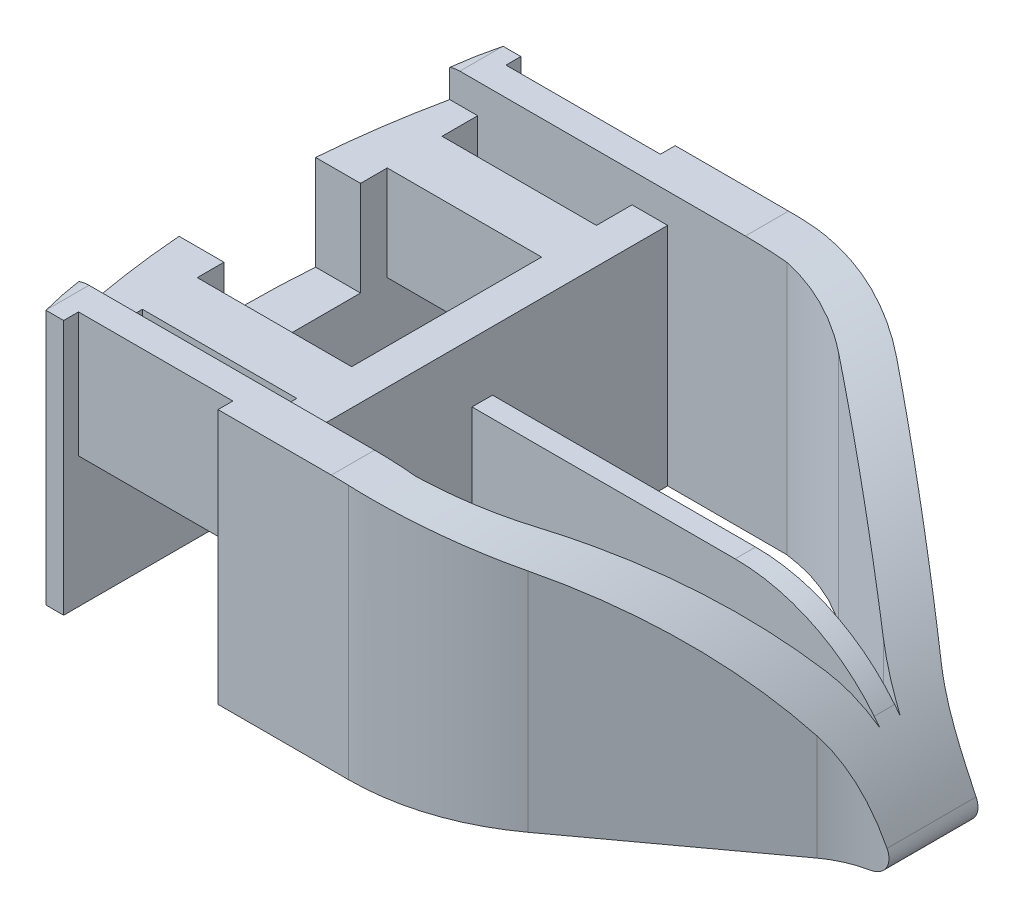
ISO-10303-21;
HEADER;
FILE_DESCRIPTION(('STEP AP214'),'2;1');
FILE_NAME('part.step','',(''),(''),'','','');
FILE_SCHEMA(('AUTOMOTIVE_DESIGN { 1 0 10303 214 1 1 1 1 }'));
ENDSEC;
DATA;
#1=APPLICATION_CONTEXT('core data for automotive mechanical design processes');
#2=APPLICATION_PROTOCOL_DEFINITION('international standard','automotive_design',2000,#1);
#3=PRODUCT_CONTEXT('',#1,'mechanical');
#4=PRODUCT('Part','Part','',(#3));
#5=PRODUCT_RELATED_PRODUCT_CATEGORY('part','',(#4));
#6=PRODUCT_DEFINITION_FORMATION('','',#4);
#7=PRODUCT_DEFINITION_CONTEXT('part definition',#1,'design');
#8=PRODUCT_DEFINITION('design','',#6,#7);
#9=PRODUCT_DEFINITION_SHAPE('','',#8);
#10=(LENGTH_UNIT() NAMED_UNIT(*) SI_UNIT(.MILLI.,.METRE.));
#11=(NAMED_UNIT(*) PLANE_ANGLE_UNIT() SI_UNIT($,.RADIAN.));
#12=(NAMED_UNIT(*) SI_UNIT($,.STERADIAN.) SOLID_ANGLE_UNIT());
#13=UNCERTAINTY_MEASURE_WITH_UNIT(LENGTH_MEASURE(1.E-05),#10,'distance_accuracy_value','');
#14=(GEOMETRIC_REPRESENTATION_CONTEXT(3) GLOBAL_UNCERTAINTY_ASSIGNED_CONTEXT((#13)) GLOBAL_UNIT_ASSIGNED_CONTEXT((#10,
#11,#12)) REPRESENTATION_CONTEXT('',''));
#15=CARTESIAN_POINT('',(0.,0.,0.));
#16=DIRECTION('',(0.,0.,1.));
#17=DIRECTION('',(1.,0.,0.));
#18=AXIS2_PLACEMENT_3D('',#15,#16,#17);
#19=CARTESIAN_POINT('',(5.,38.,38.5));
#20=DIRECTION('',(0.,0.,1.));
#21=DIRECTION('',(1.,0.,0.));
#22=AXIS2_PLACEMENT_3D('',#19,#20,#21);
#23=PLANE('',#22);
#24=DIRECTION('',(0.,1.,0.));
#25=VECTOR('',#24,1.);
#26=CARTESIAN_POINT('',(8.,0.,38.5));
#27=LINE('',#26,#25);
#28=CARTESIAN_POINT('',(8.,0.,38.5));
#29=VERTEX_POINT('',#28);
#30=CARTESIAN_POINT('',(7.99999999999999,43.,38.5));
#31=VERTEX_POINT('',#30);
#32=EDGE_CURVE('E383',#29,#31,#27,.T.);
#33=ORIENTED_EDGE('',*,*,#32,.T.);
#34=DIRECTION('',(-1.,0.,0.));
#35=VECTOR('',#34,1.);
#36=CARTESIAN_POINT('',(53.0917367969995,42.9999999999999,38.4999999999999));
#37=LINE('',#36,#35);
#38=CARTESIAN_POINT('',(5.02500215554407,43.,38.4999999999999));
#39=VERTEX_POINT('',#38);
#40=EDGE_CURVE('E387',#31,#39,#37,.T.);
#41=ORIENTED_EDGE('',*,*,#40,.T.);
#42=DIRECTION('',(0.,1.,0.));
#43=VECTOR('',#42,1.);
#44=CARTESIAN_POINT('',(5.02500215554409,0.,38.5));
#45=LINE('',#44,#43);
#46=CARTESIAN_POINT('',(5.02500215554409,0.,38.5));
#47=VERTEX_POINT('',#46);
#48=EDGE_CURVE('E1144',#47,#39,#45,.T.);
#49=ORIENTED_EDGE('',*,*,#48,.F.);
#50=DIRECTION('',(1.,0.,0.));
#51=VECTOR('',#50,1.);
#52=CARTESIAN_POINT('',(8.,0.,38.5));
#53=LINE('',#52,#51);
#54=EDGE_CURVE('E390',#47,#29,#53,.T.);
#55=ORIENTED_EDGE('',*,*,#54,.T.);
#56=EDGE_LOOP('',(#33,#41,#49,#55));
#57=FACE_BOUND('',#56,.T.);
#58=ADVANCED_FACE('F40',(#57),#23,.T.);
#59=CARTESIAN_POINT('',(4.99999999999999,38.,-38.5000000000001));
#60=DIRECTION('',(0.,0.,1.));
#61=DIRECTION('',(1.,0.,0.));
#62=AXIS2_PLACEMENT_3D('',#59,#60,#61);
#63=PLANE('',#62);
#64=DIRECTION('',(-1.,0.,0.));
#65=VECTOR('',#64,1.);
#66=CARTESIAN_POINT('',(53.0917367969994,42.9999999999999,-38.5));
#67=LINE('',#66,#65);
#68=CARTESIAN_POINT('',(7.99999999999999,43.,-38.5000000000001));
#69=VERTEX_POINT('',#68);
#70=CARTESIAN_POINT('',(5.02500215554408,43.,-38.5000000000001));
#71=VERTEX_POINT('',#70);
#72=EDGE_CURVE('E1042',#69,#71,#67,.T.);
#73=ORIENTED_EDGE('',*,*,#72,.F.);
#74=DIRECTION('',(0.,1.,0.));
#75=VECTOR('',#74,1.);
#76=CARTESIAN_POINT('',(8.00000000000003,0.,-38.5));
#77=LINE('',#76,#75);
#78=CARTESIAN_POINT('',(8.00000000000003,0.,-38.5));
#79=VERTEX_POINT('',#78);
#80=EDGE_CURVE('E1021',#79,#69,#77,.T.);
#81=ORIENTED_EDGE('',*,*,#80,.F.);
#82=DIRECTION('',(1.,0.,0.));
#83=VECTOR('',#82,1.);
#84=CARTESIAN_POINT('',(8.00000000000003,0.,-38.5));
#85=LINE('',#84,#83);
#86=CARTESIAN_POINT('',(5.02500215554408,0.,-38.5000000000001));
#87=VERTEX_POINT('',#86);
#88=EDGE_CURVE('E1097',#87,#79,#85,.T.);
#89=ORIENTED_EDGE('',*,*,#88,.F.);
#90=DIRECTION('',(0.,1.,0.));
#91=VECTOR('',#90,1.);
#92=CARTESIAN_POINT('',(5.02500215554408,0.,-38.5000000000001));
#93=LINE('',#92,#91);
#94=EDGE_CURVE('E1089',#87,#71,#93,.T.);
#95=ORIENTED_EDGE('',*,*,#94,.T.);
#96=EDGE_LOOP('',(#73,#81,#89,#95));
#97=FACE_BOUND('',#96,.T.);
#98=ADVANCED_FACE('F596',(#97),#63,.F.);
#99=CARTESIAN_POINT('',(53.0917367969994,-27.,38.5));
#100=DIRECTION('',(0.,0.,-1.));
#101=DIRECTION('',(-1.,0.,0.));
#102=AXIS2_PLACEMENT_3D('',#99,#100,#101);
#103=CYLINDRICAL_SURFACE('',#102,70.);
#104=CARTESIAN_POINT('',(53.0917367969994,-27.,-1.72316748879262));
#105=DIRECTION('',(0.,0.,1.));
#106=DIRECTION('',(1.,0.,0.));
#107=AXIS2_PLACEMENT_3D('',#104,#105,#106);
#108=CIRCLE('',#107,70.);
#109=CARTESIAN_POINT('',(108.682459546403,15.540234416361,-1.72316748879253));
#110=VERTEX_POINT('',#109);
#111=CARTESIAN_POINT('',(107.735469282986,16.7499999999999,-1.72316748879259));
#112=VERTEX_POINT('',#111);
#113=EDGE_CURVE('E883',#110,#112,#108,.T.);
#114=ORIENTED_EDGE('',*,*,#113,.T.);
#115=DIRECTION('',(0.,0.,-1.));
#116=VECTOR('',#115,1.);
#117=CARTESIAN_POINT('',(107.735469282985,16.7499999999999,38.5));
#118=LINE('',#117,#116);
#119=CARTESIAN_POINT('',(107.735469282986,16.7499999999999,1.72316748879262));
#120=VERTEX_POINT('',#119);
#121=EDGE_CURVE('E50',#112,#120,#118,.F.);
#122=ORIENTED_EDGE('',*,*,#121,.T.);
#123=CARTESIAN_POINT('',(53.0917367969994,-27.,1.72316748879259));
#124=DIRECTION('',(0.,0.,-1.));
#125=DIRECTION('',(-1.,0.,0.));
#126=AXIS2_PLACEMENT_3D('',#123,#124,#125);
#127=CIRCLE('',#126,70.);
#128=CARTESIAN_POINT('',(108.682459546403,15.540234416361,1.72316748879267));
#129=VERTEX_POINT('',#128);
#130=EDGE_CURVE('E851',#120,#129,#127,.T.);
#131=ORIENTED_EDGE('',*,*,#130,.T.);
#132=CARTESIAN_POINT('',(108.682459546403,15.540234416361,1.72316748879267));
#133=CARTESIAN_POINT('',(108.443024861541,15.8531258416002,1.80552033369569));
#134=CARTESIAN_POINT('',(108.201623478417,16.1631055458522,1.89305723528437));
#135=CARTESIAN_POINT('',(107.715271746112,16.7769667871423,2.07916931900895));
#136=CARTESIAN_POINT('',(107.470320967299,17.0808475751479,2.17774584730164));
#137=CARTESIAN_POINT('',(106.733605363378,17.9794061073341,2.48982421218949));
#138=CARTESIAN_POINT('',(106.237251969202,18.5645555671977,2.72059467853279));
#139=CARTESIAN_POINT('',(105.487331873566,19.4203181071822,3.10495667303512));
#140=CARTESIAN_POINT('',(105.236403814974,19.7019721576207,3.23947919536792));
#141=CARTESIAN_POINT('',(104.733447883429,20.2575282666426,3.52185918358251));
#142=CARTESIAN_POINT('',(104.481420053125,20.5314306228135,3.66971613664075));
#143=CARTESIAN_POINT('',(103.975677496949,21.0724701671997,3.98016330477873));
#144=CARTESIAN_POINT('',(103.721961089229,21.3395621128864,4.14282974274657));
#145=CARTESIAN_POINT('',(103.215081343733,21.8649561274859,4.48273838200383));
#146=CARTESIAN_POINT('',(102.961918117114,22.1232565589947,4.65998327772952));
#147=CARTESIAN_POINT('',(102.70951014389,22.3768829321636,4.8447561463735));
#148=B_SPLINE_CURVE_WITH_KNOTS('',3,(#132,#133,#134,#135,#136,#137,#138,#139,#140,#141,#142,
#143,#144,#145,#146,#147),.UNSPECIFIED.,.F.,.F.,(4,2,2,2,2,2,2,4),(0.,1.20739626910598,
2.41493992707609,4.81633273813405,6.01756312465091,7.21874733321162,8.42650714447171,
9.63449068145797),.UNSPECIFIED.);
#149=CARTESIAN_POINT('',(102.70951014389,22.3768829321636,4.84475614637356));
#150=VERTEX_POINT('',#149);
#151=EDGE_CURVE('E1053',#129,#150,#148,.T.);
#152=ORIENTED_EDGE('',*,*,#151,.T.);
#153=CARTESIAN_POINT('',(53.0917367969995,-27.,41.1672929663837));
#154=DIRECTION('',(0.590688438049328,0.,0.806899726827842));
#155=DIRECTION('',(0.806899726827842,0.,-0.590688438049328));
#156=AXIS2_PLACEMENT_3D('',#153,#154,#155);
#157=ELLIPSE('',#156,86.7517953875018,70.);
#158=CARTESIAN_POINT('',(74.606685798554,39.6116128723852,25.417341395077));
#159=VERTEX_POINT('',#158);
#160=EDGE_CURVE('E1060',#150,#159,#157,.T.);
#161=ORIENTED_EDGE('',*,*,#160,.T.);
#162=CARTESIAN_POINT('',(74.606685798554,39.6116128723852,25.417341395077));
#163=CARTESIAN_POINT('',(74.2611968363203,39.7232040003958,25.6702514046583));
#164=CARTESIAN_POINT('',(73.9103325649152,39.8335595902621,25.9162843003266));
#165=CARTESIAN_POINT('',(73.1981884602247,40.0512434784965,26.3942476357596));
#166=CARTESIAN_POINT('',(72.836908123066,40.1585716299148,26.6261773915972));
#167=CARTESIAN_POINT('',(71.7375847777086,40.4752831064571,27.3005064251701));
#168=CARTESIAN_POINT('',(70.9844487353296,40.6792667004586,27.7211602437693));
#169=CARTESIAN_POINT('',(69.4590553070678,41.0640594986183,28.4924273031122));
#170=CARTESIAN_POINT('',(68.6875671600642,41.2452754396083,28.8443620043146));
#171=CARTESIAN_POINT('',(67.1149738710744,41.5856817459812,29.4860677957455));
#172=CARTESIAN_POINT('',(66.3138859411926,41.7448846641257,29.7758743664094));
#173=CARTESIAN_POINT('',(64.628283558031,42.0484764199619,30.3090476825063));
#174=CARTESIAN_POINT('',(63.7418966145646,42.1909956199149,30.5476204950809));
#175=CARTESIAN_POINT('',(62.3909334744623,42.3810888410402,30.8483787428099));
#176=CARTESIAN_POINT('',(61.9342971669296,42.4407855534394,30.9394786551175));
#177=CARTESIAN_POINT('',(61.0163119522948,42.5515277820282,31.1015090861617));
#178=CARTESIAN_POINT('',(60.5549619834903,42.6025713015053,31.1724349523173));
#179=CARTESIAN_POINT('',(60.0917367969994,42.6491205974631,31.2331184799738));
#180=B_SPLINE_CURVE_WITH_KNOTS('',3,(#162,#163,#164,#165,#166,#167,#168,#169,#170,#171,#172,
#173,#174,#175,#176,#177,#178,#179),.UNSPECIFIED.,.F.,.F.,(4,2,2,2,2,2,2,2,4),(0.,
1.32722430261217,2.65451291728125,5.31058265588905,7.90903303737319,10.5059955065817,
13.2884020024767,14.6962747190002,16.1044718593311),.UNSPECIFIED.);
#181=CARTESIAN_POINT('',(60.0917367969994,42.6491205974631,31.2331184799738));
#182=VERTEX_POINT('',#181);
#183=EDGE_CURVE('E966',#159,#182,#180,.T.);
#184=ORIENTED_EDGE('',*,*,#183,.T.);
#185=CARTESIAN_POINT('',(53.0917367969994,-27.0000000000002,31.2331184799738));
#186=DIRECTION('',(0.,0.,1.));
#187=DIRECTION('',(1.,0.,0.));
#188=AXIS2_PLACEMENT_3D('',#185,#186,#187);
#189=CIRCLE('',#188,70.);
#190=CARTESIAN_POINT('',(53.0917367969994,42.9999999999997,31.2331184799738));
#191=VERTEX_POINT('',#190);
#192=EDGE_CURVE('E828',#182,#191,#189,.T.);
#193=ORIENTED_EDGE('',*,*,#192,.T.);
#194=DIRECTION('',(0.,0.,-1.));
#195=VECTOR('',#194,1.);
#196=CARTESIAN_POINT('',(53.0917367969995,42.9999999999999,38.4999999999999));
#197=LINE('',#196,#195);
#198=CARTESIAN_POINT('',(53.0917367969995,42.9999999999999,38.4999999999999));
#199=VERTEX_POINT('',#198);
#200=EDGE_CURVE('E430',#199,#191,#197,.T.);
#201=ORIENTED_EDGE('',*,*,#200,.F.);
#202=CARTESIAN_POINT('',(53.0917367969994,-27.,38.5));
#203=DIRECTION('',(0.,0.,1.));
#204=DIRECTION('',(1.,0.,0.));
#205=AXIS2_PLACEMENT_3D('',#202,#203,#204);
#206=CIRCLE('',#205,70.);
#207=CARTESIAN_POINT('',(56.0000000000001,42.939559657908,38.5));
#208=VERTEX_POINT('',#207);
#209=EDGE_CURVE('E413',#208,#199,#206,.T.);
#210=ORIENTED_EDGE('',*,*,#209,.F.);
#211=CARTESIAN_POINT('',(78.7415048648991,38.1313242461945,31.0656394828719));
#212=CARTESIAN_POINT('',(78.3293198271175,38.2936506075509,31.367371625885));
#213=CARTESIAN_POINT('',(77.9106712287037,38.4539991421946,31.6612476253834));
#214=CARTESIAN_POINT('',(77.0607326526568,38.7699996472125,32.2328714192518));
#215=CARTESIAN_POINT('',(76.6294417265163,38.9256512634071,32.5106179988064));
#216=CARTESIAN_POINT('',(75.3168142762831,39.3845228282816,33.3191669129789));
#217=CARTESIAN_POINT('',(74.4170197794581,39.6795417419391,33.8250609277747));
#218=CARTESIAN_POINT('',(72.599072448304,40.2334822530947,34.7524437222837));
#219=CARTESIAN_POINT('',(71.6821763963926,40.4931937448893,35.1759293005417));
#220=CARTESIAN_POINT('',(69.8107851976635,40.9809368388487,35.9518797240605));
#221=CARTESIAN_POINT('',(68.856298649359,41.2089756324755,36.304360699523));
#222=CARTESIAN_POINT('',(66.9523686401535,41.6206605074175,36.9223343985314));
#223=CARTESIAN_POINT('',(66.0041342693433,41.8056731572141,37.1906435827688));
#224=CARTESIAN_POINT('',(64.0835230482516,42.1384822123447,37.6547747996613));
#225=CARTESIAN_POINT('',(63.1111474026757,42.2862804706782,37.8506004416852));
#226=CARTESIAN_POINT('',(61.6260960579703,42.4796648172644,38.0901332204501));
#227=CARTESIAN_POINT('',(61.1196236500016,42.5400212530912,38.1615209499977));
#228=CARTESIAN_POINT('',(60.1030369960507,42.6498593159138,38.2841625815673));
#229=CARTESIAN_POINT('',(59.5929227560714,42.6993409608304,38.3354165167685));
#230=CARTESIAN_POINT('',(58.569830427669,42.7872062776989,38.4175669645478));
#231=CARTESIAN_POINT('',(58.056850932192,42.8255838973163,38.4484523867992));
#232=CARTESIAN_POINT('',(57.029330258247,42.8910643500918,38.489675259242));
#233=CARTESIAN_POINT('',(56.5147890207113,42.9181667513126,38.5000119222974));
#234=CARTESIAN_POINT('',(56.0000000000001,42.939559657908,38.5));
#235=B_SPLINE_CURVE_WITH_KNOTS('',3,(#211,#212,#213,#214,#215,#216,#217,#218,#219,#220,#221,
#222,#223,#224,#225,#226,#227,#228,#229,#230,#231,#232,#233,#234),.UNSPECIFIED.,.F.,.F.,(4,2,2,
2,2,2,2,2,2,2,2,4),(0.,1.60777052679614,3.21566198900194,6.43260045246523,9.55773097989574,
12.6821507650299,15.6868083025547,18.6913162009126,20.2359661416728,21.7806135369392,
23.3261012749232,24.871648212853),.UNSPECIFIED.);
#236=CARTESIAN_POINT('',(78.7415048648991,38.1313242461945,31.0656394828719));
#237=VERTEX_POINT('',#236);
#238=EDGE_CURVE('E548',#237,#208,#235,.T.);
#239=ORIENTED_EDGE('',*,*,#238,.F.);
#240=CARTESIAN_POINT('',(53.0917367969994,-27.,49.842472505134));
#241=DIRECTION('',(0.590688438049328,0.,0.806899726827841));
#242=DIRECTION('',(0.806899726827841,0.,-0.590688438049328));
#243=AXIS2_PLACEMENT_3D('',#240,#241,#242);
#244=ELLIPSE('',#243,86.7517953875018,70.);
#245=CARTESIAN_POINT('',(106.844329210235,17.8403703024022,10.4930542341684));
#246=VERTEX_POINT('',#245);
#247=EDGE_CURVE('E469',#246,#237,#244,.T.);
#248=ORIENTED_EDGE('',*,*,#247,.F.);
#249=CARTESIAN_POINT('',(115.682459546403,4.34328358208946,7.50325298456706));
#250=CARTESIAN_POINT('',(115.453479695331,4.80055708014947,7.50796237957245));
#251=CARTESIAN_POINT('',(115.21948289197,5.25530540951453,7.5178185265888));
#252=CARTESIAN_POINT('',(114.741703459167,6.15935521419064,7.54929866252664));
#253=CARTESIAN_POINT('',(114.497918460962,6.60865533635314,7.57092551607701));
#254=CARTESIAN_POINT('',(114.000051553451,7.50275317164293,7.62751954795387));
#255=CARTESIAN_POINT('',(113.7459365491,7.94752958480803,7.66253321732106));
#256=CARTESIAN_POINT('',(113.228665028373,8.8303158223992,7.74751139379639));
#257=CARTESIAN_POINT('',(112.965509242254,9.26832618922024,7.79747469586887));
#258=CARTESIAN_POINT('',(112.437126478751,10.1264388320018,7.91267835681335));
#259=CARTESIAN_POINT('',(112.17210172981,10.5467184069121,7.97752215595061));
#260=CARTESIAN_POINT('',(111.634626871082,11.379363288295,8.12481399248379));
#261=CARTESIAN_POINT('',(111.362177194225,11.7917290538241,8.20726100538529));
#262=CARTESIAN_POINT('',(110.811089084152,12.6070464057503,8.39145833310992));
#263=CARTESIAN_POINT('',(110.532460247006,13.0100108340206,8.49318034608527));
#264=CARTESIAN_POINT('',(109.969747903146,13.8059958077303,8.71791931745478));
#265=CARTESIAN_POINT('',(109.685665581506,14.1990184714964,8.84093169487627));
#266=CARTESIAN_POINT('',(109.190059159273,14.8700681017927,9.07418639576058));
#267=CARTESIAN_POINT('',(108.979490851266,15.150688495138,9.17901754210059));
#268=CARTESIAN_POINT('',(108.55679526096,15.705372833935,9.40199304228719));
#269=CARTESIAN_POINT('',(108.344668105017,15.9794373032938,9.5201363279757));
#270=CARTESIAN_POINT('',(107.917745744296,16.5227413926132,9.77165543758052));
#271=CARTESIAN_POINT('',(107.702943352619,16.7919185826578,9.90515444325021));
#272=CARTESIAN_POINT('',(107.273364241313,17.3223213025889,10.187435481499));
#273=CARTESIAN_POINT('',(107.058587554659,17.5835441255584,10.336222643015));
#274=CARTESIAN_POINT('',(106.844329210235,17.8403703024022,10.4930542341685));
#275=B_SPLINE_CURVE_WITH_KNOTS('',3,(#249,#250,#251,#252,#253,#254,#255,#256,#257,#258,#259,
#260,#261,#262,#263,#264,#265,#266,#267,#268,#269,#270,#271,#272,#273,#274),.UNSPECIFIED.,.F.,
.F.,(4,2,2,2,2,2,2,2,2,2,2,2,4),(0.,1.53426440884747,3.06890237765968,4.60891912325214,
6.14881176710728,7.65164842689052,9.15439764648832,10.654957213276,12.1551943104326,
13.2534155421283,14.3515487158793,15.4592024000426,16.5672289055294),.UNSPECIFIED.);
#276=CARTESIAN_POINT('',(115.682459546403,4.34328358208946,7.50325298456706));
#277=VERTEX_POINT('',#276);
#278=EDGE_CURVE('E540',#277,#246,#275,.T.);
#279=ORIENTED_EDGE('',*,*,#278,.F.);
#280=DIRECTION('',(0.,0.,-1.));
#281=VECTOR('',#280,1.);
#282=CARTESIAN_POINT('',(115.682459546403,4.34328358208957,38.5));
#283=LINE('',#282,#281);
#284=CARTESIAN_POINT('',(115.682459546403,4.34328358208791,-7.50325298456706));
#285=VERTEX_POINT('',#284);
#286=EDGE_CURVE('E434',#277,#285,#283,.T.);
#287=ORIENTED_EDGE('',*,*,#286,.T.);
#288=CARTESIAN_POINT('',(115.682459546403,4.34328358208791,-7.50325298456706));
#289=CARTESIAN_POINT('',(115.453479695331,4.80055708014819,-7.50796237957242));
#290=CARTESIAN_POINT('',(115.21948289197,5.2553054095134,-7.51781852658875));
#291=CARTESIAN_POINT('',(114.741703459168,6.15935521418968,-7.54929866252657));
#292=CARTESIAN_POINT('',(114.497918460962,6.6086553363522,-7.57092551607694));
#293=CARTESIAN_POINT('',(114.000051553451,7.50275317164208,-7.62751954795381));
#294=CARTESIAN_POINT('',(113.745936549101,7.94752958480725,-7.66253321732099));
#295=CARTESIAN_POINT('',(113.228665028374,8.83031582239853,-7.74751139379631));
#296=CARTESIAN_POINT('',(112.965509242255,9.26832618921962,-7.79747469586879));
#297=CARTESIAN_POINT('',(112.437126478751,10.1264388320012,-7.91267835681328));
#298=CARTESIAN_POINT('',(112.17210172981,10.5467184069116,-7.97752215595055));
#299=CARTESIAN_POINT('',(111.634626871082,11.3793632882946,-8.12481399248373));
#300=CARTESIAN_POINT('',(111.362177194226,11.7917290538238,-8.20726100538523));
#301=CARTESIAN_POINT('',(110.811089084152,12.6070464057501,-8.3914583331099));
#302=CARTESIAN_POINT('',(110.532460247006,13.0100108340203,-8.49318034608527));
#303=CARTESIAN_POINT('',(109.969747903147,13.8059958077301,-8.71791931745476));
#304=CARTESIAN_POINT('',(109.685665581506,14.1990184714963,-8.84093169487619));
#305=CARTESIAN_POINT('',(109.190059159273,14.8700681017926,-9.07418639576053));
#306=CARTESIAN_POINT('',(108.979490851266,15.1506884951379,-9.17901754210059));
#307=CARTESIAN_POINT('',(108.55679526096,15.7053728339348,-9.40199304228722));
#308=CARTESIAN_POINT('',(108.344668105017,15.9794373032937,-9.52013632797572));
#309=CARTESIAN_POINT('',(107.917745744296,16.522741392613,-9.77165543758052));
#310=CARTESIAN_POINT('',(107.702943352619,16.7919185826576,-9.90515444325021));
#311=CARTESIAN_POINT('',(107.273364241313,17.3223213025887,-10.1874354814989));
#312=CARTESIAN_POINT('',(107.058587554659,17.5835441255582,-10.336222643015));
#313=CARTESIAN_POINT('',(106.844329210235,17.8403703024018,-10.4930542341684));
#314=B_SPLINE_CURVE_WITH_KNOTS('',3,(#288,#289,#290,#291,#292,#293,#294,#295,#296,#297,#298,
#299,#300,#301,#302,#303,#304,#305,#306,#307,#308,#309,#310,#311,#312,#313),.UNSPECIFIED.,.F.,
.F.,(4,2,2,2,2,2,2,2,2,2,2,2,4),(0.,1.53426440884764,3.06890237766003,4.60891912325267,
6.14881176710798,7.65164842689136,9.15439764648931,10.6549572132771,12.1551943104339,
13.2534155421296,14.3515487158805,15.4592024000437,16.5672289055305),.UNSPECIFIED.);
#315=CARTESIAN_POINT('',(106.844329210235,17.8403703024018,-10.4930542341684));
#316=VERTEX_POINT('',#315);
#317=EDGE_CURVE('E460',#285,#316,#314,.T.);
#318=ORIENTED_EDGE('',*,*,#317,.T.);
#319=CARTESIAN_POINT('',(53.0917367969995,-27.0000000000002,-49.8424725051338));
#320=DIRECTION('',(-0.590688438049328,0.,0.806899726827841));
#321=DIRECTION('',(-0.806899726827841,0.,-0.590688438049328));
#322=AXIS2_PLACEMENT_3D('',#319,#320,#321);
#323=ELLIPSE('',#322,86.7517953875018,70.);
#324=CARTESIAN_POINT('',(78.7415048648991,38.1313242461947,-31.0656394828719));
#325=VERTEX_POINT('',#324);
#326=EDGE_CURVE('E456',#316,#325,#323,.T.);
#327=ORIENTED_EDGE('',*,*,#326,.T.);
#328=CARTESIAN_POINT('',(78.7415048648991,38.1313242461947,-31.0656394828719));
#329=CARTESIAN_POINT('',(78.3293198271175,38.293650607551,-31.367371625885));
#330=CARTESIAN_POINT('',(77.9106712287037,38.4539991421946,-31.6612476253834));
#331=CARTESIAN_POINT('',(77.0607326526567,38.7699996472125,-32.2328714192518));
#332=CARTESIAN_POINT('',(76.6294417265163,38.925651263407,-32.5106179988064));
#333=CARTESIAN_POINT('',(75.3168142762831,39.3845228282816,-33.3191669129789));
#334=CARTESIAN_POINT('',(74.417019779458,39.6795417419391,-33.8250609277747));
#335=CARTESIAN_POINT('',(72.599072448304,40.2334822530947,-34.7524437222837));
#336=CARTESIAN_POINT('',(71.6821763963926,40.4931937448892,-35.1759293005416));
#337=CARTESIAN_POINT('',(69.8107851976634,40.9809368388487,-35.9518797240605));
#338=CARTESIAN_POINT('',(68.856298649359,41.2089756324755,-36.3043606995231));
#339=CARTESIAN_POINT('',(66.9523686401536,41.6206605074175,-36.9223343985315));
#340=CARTESIAN_POINT('',(66.0041342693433,41.8056731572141,-37.1906435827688));
#341=CARTESIAN_POINT('',(64.0835230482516,42.1384822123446,-37.6547747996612));
#342=CARTESIAN_POINT('',(63.1111474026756,42.2862804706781,-37.8506004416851));
#343=CARTESIAN_POINT('',(61.6260960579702,42.4796648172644,-38.0901332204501));
#344=CARTESIAN_POINT('',(61.1196236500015,42.5400212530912,-38.1615209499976));
#345=CARTESIAN_POINT('',(60.1030369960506,42.6498593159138,-38.2841625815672));
#346=CARTESIAN_POINT('',(59.5929227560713,42.6993409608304,-38.3354165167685));
#347=CARTESIAN_POINT('',(58.5698304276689,42.7872062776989,-38.4175669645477));
#348=CARTESIAN_POINT('',(58.0568509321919,42.8255838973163,-38.4484523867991));
#349=CARTESIAN_POINT('',(57.0293302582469,42.8910643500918,-38.489675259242));
#350=CARTESIAN_POINT('',(56.5147890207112,42.9181667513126,-38.5000119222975));
#351=CARTESIAN_POINT('',(56.,42.939559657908,-38.5000000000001));
#352=B_SPLINE_CURVE_WITH_KNOTS('',3,(#328,#329,#330,#331,#332,#333,#334,#335,#336,#337,#338,
#339,#340,#341,#342,#343,#344,#345,#346,#347,#348,#349,#350,#351),.UNSPECIFIED.,.F.,.F.,(4,2,2,
2,2,2,2,2,2,2,2,4),(0.,1.60777052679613,3.21566198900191,6.4326004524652,9.55773097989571,
12.6821507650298,15.6868083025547,18.6913162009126,20.2359661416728,21.7806135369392,
23.3261012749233,24.8716482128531),.UNSPECIFIED.);
#353=CARTESIAN_POINT('',(56.,42.939559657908,-38.5000000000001));
#354=VERTEX_POINT('',#353);
#355=EDGE_CURVE('E500',#325,#354,#352,.T.);
#356=ORIENTED_EDGE('',*,*,#355,.T.);
#357=CARTESIAN_POINT('',(53.0917367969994,-27.,-38.4999999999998));
#358=DIRECTION('',(0.,0.,1.));
#359=DIRECTION('',(1.,0.,0.));
#360=AXIS2_PLACEMENT_3D('',#357,#358,#359);
#361=CIRCLE('',#360,70.);
#362=CARTESIAN_POINT('',(53.0917367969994,42.9999999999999,-38.5));
#363=VERTEX_POINT('',#362);
#364=EDGE_CURVE('E1037',#354,#363,#361,.T.);
#365=ORIENTED_EDGE('',*,*,#364,.T.);
#366=CARTESIAN_POINT('',(53.0917367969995,42.9999999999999,-31.2331184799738));
#367=VERTEX_POINT('',#366);
#368=EDGE_CURVE('E429',#367,#363,#197,.T.);
#369=ORIENTED_EDGE('',*,*,#368,.F.);
#370=CARTESIAN_POINT('',(53.0917367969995,-27.,-31.2331184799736));
#371=DIRECTION('',(0.,0.,-1.));
#372=DIRECTION('',(-1.,0.,0.));
#373=AXIS2_PLACEMENT_3D('',#370,#371,#372);
#374=CIRCLE('',#373,70.);
#375=CARTESIAN_POINT('',(60.0917367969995,42.6491205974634,-31.2331184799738));
#376=VERTEX_POINT('',#375);
#377=EDGE_CURVE('E904',#367,#376,#374,.T.);
#378=ORIENTED_EDGE('',*,*,#377,.T.);
#379=CARTESIAN_POINT('',(60.0917367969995,42.6491205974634,-31.2331184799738));
#380=CARTESIAN_POINT('',(60.5282196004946,42.6052619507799,-31.1759446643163));
#381=CARTESIAN_POINT('',(60.9630937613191,42.5574016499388,-31.1096586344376));
#382=CARTESIAN_POINT('',(61.8287795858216,42.4539685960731,-30.959137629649));
#383=CARTESIAN_POINT('',(62.259591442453,42.3983962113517,-30.8749035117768));
#384=CARTESIAN_POINT('',(63.1162596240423,42.2798380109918,-30.6887757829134));
#385=CARTESIAN_POINT('',(63.5421169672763,42.2168537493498,-30.5868858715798));
#386=CARTESIAN_POINT('',(64.3881593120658,42.0838207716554,-30.3657703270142));
#387=CARTESIAN_POINT('',(64.808344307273,42.0137720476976,-30.2465446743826));
#388=CARTESIAN_POINT('',(66.0418446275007,41.7966667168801,-29.8687161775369));
#389=CARTESIAN_POINT('',(66.8462466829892,41.6401110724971,-29.5859896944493));
#390=CARTESIAN_POINT('',(68.4252581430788,41.3047188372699,-28.9583273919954));
#391=CARTESIAN_POINT('',(69.1998753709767,41.1258881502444,-28.6134080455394));
#392=CARTESIAN_POINT('',(70.3638651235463,40.8369310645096,-28.0381001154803));
#393=CARTESIAN_POINT('',(70.7654038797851,40.7333735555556,-27.8287151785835));
#394=CARTESIAN_POINT('',(71.5580709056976,40.5215720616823,-27.3934441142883));
#395=CARTESIAN_POINT('',(71.9492015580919,40.4133291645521,-27.1675618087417));
#396=CARTESIAN_POINT('',(72.7249899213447,40.1915171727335,-26.6970577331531));
#397=CARTESIAN_POINT('',(73.109521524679,40.0779011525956,-26.4522503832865));
#398=CARTESIAN_POINT('',(73.8669690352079,39.8471889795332,-25.946653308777));
#399=CARTESIAN_POINT('',(74.2398827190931,39.7300921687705,-25.6858605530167));
#400=CARTESIAN_POINT('',(74.6066857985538,39.6116128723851,-25.417341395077));
#401=B_SPLINE_CURVE_WITH_KNOTS('',3,(#379,#380,#381,#382,#383,#384,#385,#386,#387,#388,#389,
#390,#391,#392,#393,#394,#395,#396,#397,#398,#399,#400),.UNSPECIFIED.,.F.,.F.,(4,2,2,2,2,2,2,2,
2,2,4),(0.,1.3270376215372,2.65401189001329,3.9807084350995,5.30740646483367,7.90476378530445,
10.5014341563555,11.8946888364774,13.2876217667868,14.6965681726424,16.1057825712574),.UNSPECIFIED.);
#402=CARTESIAN_POINT('',(74.6066857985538,39.6116128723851,-25.417341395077));
#403=VERTEX_POINT('',#402);
#404=EDGE_CURVE('E1101',#376,#403,#401,.T.);
#405=ORIENTED_EDGE('',*,*,#404,.T.);
#406=CARTESIAN_POINT('',(53.0917367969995,-27.,-41.1672929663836));
#407=DIRECTION('',(0.590688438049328,0.,-0.806899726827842));
#408=DIRECTION('',(-0.806899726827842,0.,-0.590688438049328));
#409=AXIS2_PLACEMENT_3D('',#406,#407,#408);
#410=ELLIPSE('',#409,86.7517953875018,70.);
#411=CARTESIAN_POINT('',(102.70951014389,22.3768829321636,-4.84475614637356));
#412=VERTEX_POINT('',#411);
#413=EDGE_CURVE('E559',#403,#412,#410,.T.);
#414=ORIENTED_EDGE('',*,*,#413,.T.);
#415=CARTESIAN_POINT('',(102.70951014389,22.3768829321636,-4.84475614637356));
#416=CARTESIAN_POINT('',(102.961918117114,22.1232565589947,-4.65998327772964));
#417=CARTESIAN_POINT('',(103.215081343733,21.8649561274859,-4.48273838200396));
#418=CARTESIAN_POINT('',(103.721961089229,21.3395621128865,-4.1428297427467));
#419=CARTESIAN_POINT('',(103.975677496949,21.0724701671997,-3.98016330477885));
#420=CARTESIAN_POINT('',(104.481420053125,20.5314306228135,-3.66971613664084));
#421=CARTESIAN_POINT('',(104.733447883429,20.2575282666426,-3.52185918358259));
#422=CARTESIAN_POINT('',(105.236403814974,19.7019721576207,-3.23947919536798));
#423=CARTESIAN_POINT('',(105.487331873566,19.4203181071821,-3.10495667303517));
#424=CARTESIAN_POINT('',(106.237251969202,18.5645555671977,-2.72059467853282));
#425=CARTESIAN_POINT('',(106.733605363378,17.9794061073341,-2.48982421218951));
#426=CARTESIAN_POINT('',(107.470320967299,17.0808475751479,-2.17774584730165));
#427=CARTESIAN_POINT('',(107.715271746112,16.7769667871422,-2.07916931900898));
#428=CARTESIAN_POINT('',(108.201623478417,16.1631055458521,-1.89305723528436));
#429=CARTESIAN_POINT('',(108.443024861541,15.8531258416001,-1.80552033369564));
#430=CARTESIAN_POINT('',(108.682459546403,15.540234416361,-1.72316748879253));
#431=B_SPLINE_CURVE_WITH_KNOTS('',3,(#415,#416,#417,#418,#419,#420,#421,#422,#423,#424,#425,
#426,#427,#428,#429,#430),.UNSPECIFIED.,.F.,.F.,(4,2,2,2,2,2,2,4),(0.,1.20798353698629,
2.41574334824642,3.61692755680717,4.81815794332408,7.2195507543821,8.42709441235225,
9.63449068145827),.UNSPECIFIED.);
#432=EDGE_CURVE('E547',#412,#110,#431,.T.);
#433=ORIENTED_EDGE('',*,*,#432,.T.);
#434=EDGE_LOOP('',(#114,#122,#131,#152,#161,#184,#193,#201,#210,#239,#248,#279,#287,#318,#327,
#356,#365,#369,#378,#405,#414,#433));
#435=FACE_BOUND('',#434,.T.);
#436=ADVANCED_FACE('F471',(#435),#103,.T.);
#437=CARTESIAN_POINT('',(108.682459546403,0.,-1.72316748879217));
#438=DIRECTION('',(0.,0.,1.));
#439=DIRECTION('',(1.,0.,0.));
#440=AXIS2_PLACEMENT_3D('',#437,#438,#439);
#441=PLANE('',#440);
#442=DIRECTION('',(-1.,0.,0.));
#443=VECTOR('',#442,1.);
#444=CARTESIAN_POINT('',(116.,27.9999999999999,-1.72316748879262));
#445=LINE('',#444,#443);
#446=CARTESIAN_POINT('',(84.3167267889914,28.,-1.72316748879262));
#447=VERTEX_POINT('',#446);
#448=CARTESIAN_POINT('',(40.,27.9999999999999,-1.72316748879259));
#449=VERTEX_POINT('',#448);
#450=EDGE_CURVE('E667',#447,#449,#445,.T.);
#451=ORIENTED_EDGE('',*,*,#450,.F.);
#452=CARTESIAN_POINT('',(84.3167267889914,-2.,-1.72316748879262));
#453=DIRECTION('',(0.,0.,1.));
#454=DIRECTION('',(1.,0.,0.));
#455=AXIS2_PLACEMENT_3D('',#452,#453,#454);
#456=CIRCLE('',#455,30.);
#457=EDGE_CURVE('E1085',#447,#112,#456,.F.);
#458=ORIENTED_EDGE('',*,*,#457,.T.);
#459=ORIENTED_EDGE('',*,*,#113,.F.);
#460=DIRECTION('',(0.,1.,0.));
#461=VECTOR('',#460,1.);
#462=CARTESIAN_POINT('',(108.682459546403,0.,-1.72316748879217));
#463=LINE('',#462,#461);
#464=CARTESIAN_POINT('',(108.682459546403,0.,-1.72316748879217));
#465=VERTEX_POINT('',#464);
#466=EDGE_CURVE('E896',#465,#110,#463,.T.);
#467=ORIENTED_EDGE('',*,*,#466,.F.);
#468=DIRECTION('',(1.,0.,0.));
#469=VECTOR('',#468,1.);
#470=CARTESIAN_POINT('',(108.682459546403,0.,-1.72316748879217));
#471=LINE('',#470,#469);
#472=CARTESIAN_POINT('',(40.,-1.11022302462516E-13,-1.72316748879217));
#473=VERTEX_POINT('',#472);
#474=EDGE_CURVE('E858',#473,#465,#471,.T.);
#475=ORIENTED_EDGE('',*,*,#474,.F.);
#476=DIRECTION('',(0.,1.,0.));
#477=VECTOR('',#476,1.);
#478=CARTESIAN_POINT('',(40.,-1.11022302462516E-13,-1.72316748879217));
#479=LINE('',#478,#477);
#480=EDGE_CURVE('E878',#473,#449,#479,.T.);
#481=ORIENTED_EDGE('',*,*,#480,.T.);
#482=EDGE_LOOP('',(#451,#458,#459,#467,#475,#481));
#483=FACE_BOUND('',#482,.T.);
#484=ADVANCED_FACE('F570',(#483),#441,.F.);
#485=CARTESIAN_POINT('',(108.682459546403,0.,1.723167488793));
#486=DIRECTION('',(0.,0.,-1.));
#487=DIRECTION('',(-1.,0.,0.));
#488=AXIS2_PLACEMENT_3D('',#485,#486,#487);
#489=PLANE('',#488);
#490=ORIENTED_EDGE('',*,*,#130,.F.);
#491=CARTESIAN_POINT('',(84.3167267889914,-2.,1.72316748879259));
#492=DIRECTION('',(0.,0.,-1.));
#493=DIRECTION('',(-1.,0.,0.));
#494=AXIS2_PLACEMENT_3D('',#491,#492,#493);
#495=CIRCLE('',#494,30.);
#496=CARTESIAN_POINT('',(84.3167267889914,28.,1.72316748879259));
#497=VERTEX_POINT('',#496);
#498=EDGE_CURVE('E11',#120,#497,#495,.F.);
#499=ORIENTED_EDGE('',*,*,#498,.T.);
#500=DIRECTION('',(-1.,0.,0.));
#501=VECTOR('',#500,1.);
#502=CARTESIAN_POINT('',(116.,27.9999999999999,1.72316748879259));
#503=LINE('',#502,#501);
#504=CARTESIAN_POINT('',(40.0000000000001,27.9999999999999,1.72316748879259));
#505=VERTEX_POINT('',#504);
#506=EDGE_CURVE('E670',#497,#505,#503,.T.);
#507=ORIENTED_EDGE('',*,*,#506,.T.);
#508=DIRECTION('',(0.,1.,0.));
#509=VECTOR('',#508,1.);
#510=CARTESIAN_POINT('',(40.0000000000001,-1.11022302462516E-13,1.723167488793));
#511=LINE('',#510,#509);
#512=CARTESIAN_POINT('',(40.0000000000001,-1.11022302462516E-13,1.723167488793));
#513=VERTEX_POINT('',#512);
#514=EDGE_CURVE('E824',#513,#505,#511,.T.);
#515=ORIENTED_EDGE('',*,*,#514,.F.);
#516=DIRECTION('',(-1.,0.,0.));
#517=VECTOR('',#516,1.);
#518=CARTESIAN_POINT('',(108.682459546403,0.,1.723167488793));
#519=LINE('',#518,#517);
#520=CARTESIAN_POINT('',(108.682459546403,0.,1.723167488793));
#521=VERTEX_POINT('',#520);
#522=EDGE_CURVE('E819',#521,#513,#519,.T.);
#523=ORIENTED_EDGE('',*,*,#522,.F.);
#524=DIRECTION('',(0.,1.,0.));
#525=VECTOR('',#524,1.);
#526=CARTESIAN_POINT('',(108.682459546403,0.,1.723167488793));
#527=LINE('',#526,#525);
#528=EDGE_CURVE('E829',#521,#129,#527,.T.);
#529=ORIENTED_EDGE('',*,*,#528,.T.);
#530=EDGE_LOOP('',(#490,#499,#507,#515,#523,#529));
#531=FACE_BOUND('',#530,.T.);
#532=ADVANCED_FACE('F573',(#531),#489,.F.);
#533=CARTESIAN_POINT('',(53.0917367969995,42.9999999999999,38.4999999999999));
#534=DIRECTION('',(0.,-1.,0.));
#535=DIRECTION('',(1.,0.,0.));
#536=AXIS2_PLACEMENT_3D('',#533,#534,#535);
#537=PLANE('',#536);
#538=DIRECTION('',(1.,0.,0.));
#539=VECTOR('',#538,1.);
#540=CARTESIAN_POINT('',(7.99999999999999,43.,-36.0000000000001));
#541=LINE('',#540,#539);
#542=CARTESIAN_POINT('',(7.99999999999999,43.,-36.0000000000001));
#543=VERTEX_POINT('',#542);
#544=CARTESIAN_POINT('',(34.,42.9999999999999,-36.));
#545=VERTEX_POINT('',#544);
#546=EDGE_CURVE('E646',#543,#545,#541,.T.);
#547=ORIENTED_EDGE('',*,*,#546,.F.);
#548=DIRECTION('',(0.,0.,1.));
#549=VECTOR('',#548,1.);
#550=CARTESIAN_POINT('',(7.99999999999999,43.,-38.5000000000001));
#551=LINE('',#550,#549);
#552=EDGE_CURVE('E642',#69,#543,#551,.T.);
#553=ORIENTED_EDGE('',*,*,#552,.F.);
#554=ORIENTED_EDGE('',*,*,#72,.T.);
#555=CARTESIAN_POINT('',(150.,43.,0.));
#556=DIRECTION('',(0.,-1.,0.));
#557=DIRECTION('',(-1.,0.,0.));
#558=AXIS2_PLACEMENT_3D('',#555,#556,#557);
#559=CIRCLE('',#558,150.);
#560=CARTESIAN_POINT('',(5.00000000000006,43.,-38.4057287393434));
#561=VERTEX_POINT('',#560);
#562=EDGE_CURVE('E499',#561,#71,#559,.T.);
#563=ORIENTED_EDGE('',*,*,#562,.F.);
#564=DIRECTION('',(0.,0.,-1.));
#565=VECTOR('',#564,1.);
#566=CARTESIAN_POINT('',(5.00000000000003,43.,38.4999999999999));
#567=LINE('',#566,#565);
#568=CARTESIAN_POINT('',(5.00000000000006,43.,-31.2331184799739));
#569=VERTEX_POINT('',#568);
#570=EDGE_CURVE('E419',#569,#561,#567,.T.);
#571=ORIENTED_EDGE('',*,*,#570,.F.);
#572=DIRECTION('',(-1.,0.,0.));
#573=VECTOR('',#572,1.);
#574=CARTESIAN_POINT('',(34.,43.,-31.2331184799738));
#575=LINE('',#574,#573);
#576=EDGE_CURVE('E908',#367,#569,#575,.T.);
#577=ORIENTED_EDGE('',*,*,#576,.F.);
#578=ORIENTED_EDGE('',*,*,#368,.T.);
#579=CARTESIAN_POINT('',(34.,42.9999999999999,-38.5));
#580=VERTEX_POINT('',#579);
#581=EDGE_CURVE('E1027',#363,#580,#67,.T.);
#582=ORIENTED_EDGE('',*,*,#581,.T.);
#583=DIRECTION('',(0.,0.,-1.));
#584=VECTOR('',#583,1.);
#585=CARTESIAN_POINT('',(34.,42.9999999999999,-38.5));
#586=LINE('',#585,#584);
#587=EDGE_CURVE('E650',#545,#580,#586,.T.);
#588=ORIENTED_EDGE('',*,*,#587,.F.);
#589=EDGE_LOOP('',(#547,#553,#554,#563,#571,#577,#578,#582,#588));
#590=FACE_BOUND('',#589,.T.);
#591=ADVANCED_FACE('F1025',(#590),#537,.F.);
#592=CARTESIAN_POINT('',(5.,38.,38.5));
#593=DIRECTION('',(0.,0.,-1.));
#594=DIRECTION('',(-1.,0.,0.));
#595=AXIS2_PLACEMENT_3D('',#592,#593,#594);
#596=CYLINDRICAL_SURFACE('',#595,5.);
#597=CARTESIAN_POINT('',(5.,38.,-31.2331184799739));
#598=DIRECTION('',(0.,0.,1.));
#599=DIRECTION('',(1.,0.,0.));
#600=AXIS2_PLACEMENT_3D('',#597,#598,#599);
#601=CIRCLE('',#600,5.);
#602=CARTESIAN_POINT('',(3.2877227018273,42.6976703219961,-31.2331184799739));
#603=VERTEX_POINT('',#602);
#604=EDGE_CURVE('E742',#569,#603,#601,.T.);
#605=ORIENTED_EDGE('',*,*,#604,.F.);
#606=ORIENTED_EDGE('',*,*,#570,.T.);
#607=CARTESIAN_POINT('',(5.00000000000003,43.,-38.4057287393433));
#608=CARTESIAN_POINT('',(4.89299685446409,42.9999861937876,-38.0017426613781));
#609=CARTESIAN_POINT('',(4.78768546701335,42.9965653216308,-37.5973184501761));
#610=CARTESIAN_POINT('',(4.58047417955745,42.9834536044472,-36.7877161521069));
#611=CARTESIAN_POINT('',(4.47857412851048,42.9737630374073,-36.3825380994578));
#612=CARTESIAN_POINT('',(4.2782323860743,42.9486595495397,-35.5716295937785));
#613=CARTESIAN_POINT('',(4.17978972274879,42.9332482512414,-35.1658993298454));
#614=CARTESIAN_POINT('',(3.98634613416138,42.8971608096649,-34.353851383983));
#615=CARTESIAN_POINT('',(3.89134525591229,42.8764845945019,-33.9475336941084));
#616=CARTESIAN_POINT('',(3.61161841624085,42.8072159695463,-32.728228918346));
#617=CARTESIAN_POINT('',(3.43206078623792,42.7513691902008,-31.9144550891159));
#618=CARTESIAN_POINT('',(3.08676261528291,42.6231393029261,-30.2852151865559));
#619=CARTESIAN_POINT('',(2.92102376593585,42.5507541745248,-29.4697489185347));
#620=CARTESIAN_POINT('',(2.53169863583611,42.3559132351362,-27.4691832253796));
#621=CARTESIAN_POINT('',(2.31576113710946,42.2256031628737,-26.2833518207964));
#622=CARTESIAN_POINT('',(1.91292668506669,41.9409111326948,-23.9095848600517));
#623=CARTESIAN_POINT('',(1.72603261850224,41.7865267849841,-22.7216491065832));
#624=CARTESIAN_POINT('',(1.38111481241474,41.45837372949,-20.3438137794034));
#625=CARTESIAN_POINT('',(1.22310204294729,41.2845976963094,-19.1539136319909));
#626=CARTESIAN_POINT('',(0.935908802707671,40.9217610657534,-16.7730286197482));
#627=CARTESIAN_POINT('',(0.806727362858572,40.7327009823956,-15.5820437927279));
#628=CARTESIAN_POINT('',(0.577010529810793,40.3427327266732,-13.1986442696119));
#629=CARTESIAN_POINT('',(0.476489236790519,40.1418187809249,-12.0062291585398));
#630=CARTESIAN_POINT('',(0.304073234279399,39.731419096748,-9.62079571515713));
#631=CARTESIAN_POINT('',(0.232180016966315,39.5219329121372,-8.42777735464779));
#632=CARTESIAN_POINT('',(0.0593733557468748,38.8852186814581,-4.84895531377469));
#633=CARTESIAN_POINT('',(0.00123143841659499,38.4495571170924,-2.46233007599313));
#634=CARTESIAN_POINT('',(6.45234906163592E-06,38.0092747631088,-0.0507999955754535));
#635=CARTESIAN_POINT('',(7.8187175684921E-10,38.0046373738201,-0.0253999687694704));
#636=CARTESIAN_POINT('',(0.,38.,0.));
#637=B_SPLINE_CURVE_WITH_KNOTS('',3,(#607,#608,#609,#610,#611,#612,#613,#614,#615,#616,#617,
#618,#619,#620,#621,#622,#623,#624,#625,#626,#627,#628,#629,#630,#631,#632,#633,#634,#635,#636),
.UNSPECIFIED.,.F.,.F.,(4,2,2,2,2,2,2,2,2,2,2,2,2,2,4),(0.,1.25371870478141,2.50738182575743,
3.7606896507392,5.01401458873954,7.51931994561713,10.0249315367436,13.6612987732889,
17.2980272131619,20.9361341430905,24.5741187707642,28.2138901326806,31.8538511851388,
39.1305534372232,39.2080131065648),.UNSPECIFIED.);
#638=EDGE_CURVE('E1091',#561,#603,#637,.T.);
#639=ORIENTED_EDGE('',*,*,#638,.T.);
#640=EDGE_LOOP('',(#605,#606,#639));
#641=FACE_BOUND('',#640,.T.);
#642=ADVANCED_FACE('F42',(#641),#596,.T.);
#643=CARTESIAN_POINT('',(5.,37.9999999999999,31.2331184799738));
#644=DIRECTION('',(0.,0.,-1.));
#645=DIRECTION('',(-1.,0.,0.));
#646=AXIS2_PLACEMENT_3D('',#643,#644,#645);
#647=CIRCLE('',#646,5.);
#648=CARTESIAN_POINT('',(3.2877227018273,42.697670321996,31.2331184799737));
#649=VERTEX_POINT('',#648);
#650=CARTESIAN_POINT('',(5.00000000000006,42.9999999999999,31.2331184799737));
#651=VERTEX_POINT('',#650);
#652=EDGE_CURVE('E738',#649,#651,#647,.T.);
#653=ORIENTED_EDGE('',*,*,#652,.F.);
#654=CARTESIAN_POINT('',(5.00000000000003,43.,38.4057287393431));
#655=CARTESIAN_POINT('',(4.89299685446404,42.9999861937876,38.0017426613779));
#656=CARTESIAN_POINT('',(4.78768546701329,42.9965653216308,37.5973184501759));
#657=CARTESIAN_POINT('',(4.58047417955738,42.9834536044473,36.7877161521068));
#658=CARTESIAN_POINT('',(4.47857412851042,42.9737630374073,36.3825380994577));
#659=CARTESIAN_POINT('',(4.27823238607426,42.9486595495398,35.5716295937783));
#660=CARTESIAN_POINT('',(4.17978972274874,42.9332482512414,35.1658993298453));
#661=CARTESIAN_POINT('',(3.98634613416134,42.8971608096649,34.3538513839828));
#662=CARTESIAN_POINT('',(3.89134525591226,42.876484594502,33.9475336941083));
#663=CARTESIAN_POINT('',(3.61161841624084,42.8072159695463,32.728228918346));
#664=CARTESIAN_POINT('',(3.43206078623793,42.7513691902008,31.9144550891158));
#665=CARTESIAN_POINT('',(3.08676261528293,42.6231393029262,30.2852151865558));
#666=CARTESIAN_POINT('',(2.92102376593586,42.5507541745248,29.4697489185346));
#667=CARTESIAN_POINT('',(2.53169863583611,42.3559132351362,27.4691832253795));
#668=CARTESIAN_POINT('',(2.31576113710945,42.2256031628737,26.2833518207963));
#669=CARTESIAN_POINT('',(1.91292668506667,41.9409111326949,23.9095848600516));
#670=CARTESIAN_POINT('',(1.7260326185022,41.7865267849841,22.7216491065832));
#671=CARTESIAN_POINT('',(1.38111481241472,41.45837372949,20.3438137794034));
#672=CARTESIAN_POINT('',(1.2231020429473,41.2845976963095,19.1539136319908));
#673=CARTESIAN_POINT('',(0.935908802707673,40.9217610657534,16.7730286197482));
#674=CARTESIAN_POINT('',(0.806727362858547,40.7327009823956,15.5820437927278));
#675=CARTESIAN_POINT('',(0.57701052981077,40.3427327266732,13.1986442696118));
#676=CARTESIAN_POINT('',(0.476489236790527,40.1418187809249,12.0062291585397));
#677=CARTESIAN_POINT('',(0.304073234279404,39.731419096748,9.6207957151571));
#678=CARTESIAN_POINT('',(0.232180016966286,39.5219329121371,8.42777735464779));
#679=CARTESIAN_POINT('',(0.0593733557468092,38.8852186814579,4.84895531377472));
#680=CARTESIAN_POINT('',(0.0012314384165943,38.4495571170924,2.46233007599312));
#681=CARTESIAN_POINT('',(6.45234906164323E-06,38.0092747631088,0.0507999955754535));
#682=CARTESIAN_POINT('',(7.81871764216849E-10,38.0046373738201,0.0253999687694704));
#683=CARTESIAN_POINT('',(0.,38.,0.));
#684=B_SPLINE_CURVE_WITH_KNOTS('',3,(#654,#655,#656,#657,#658,#659,#660,#661,#662,#663,#664,
#665,#666,#667,#668,#669,#670,#671,#672,#673,#674,#675,#676,#677,#678,#679,#680,#681,#682,#683),
.UNSPECIFIED.,.F.,.F.,(4,2,2,2,2,2,2,2,2,2,2,2,2,2,4),(0.,1.25371870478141,2.50738182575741,
3.76068965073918,5.0140145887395,7.51931994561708,10.0249315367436,13.6612987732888,
17.2980272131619,20.9361341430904,24.5741187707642,28.2138901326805,31.8538511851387,
39.130553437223,39.2080131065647),.UNSPECIFIED.);
#685=CARTESIAN_POINT('',(5.00000000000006,43.,38.4057287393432));
#686=VERTEX_POINT('',#685);
#687=EDGE_CURVE('E1141',#686,#649,#684,.T.);
#688=ORIENTED_EDGE('',*,*,#687,.F.);
#689=EDGE_CURVE('E425',#686,#651,#567,.T.);
#690=ORIENTED_EDGE('',*,*,#689,.T.);
#691=EDGE_LOOP('',(#653,#688,#690));
#692=FACE_BOUND('',#691,.T.);
#693=ADVANCED_FACE('F1406',(#692),#596,.T.);
#694=ORIENTED_EDGE('',*,*,#40,.F.);
#695=DIRECTION('',(0.,0.,1.));
#696=VECTOR('',#695,1.);
#697=CARTESIAN_POINT('',(7.99999999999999,43.,38.5));
#698=LINE('',#697,#696);
#699=CARTESIAN_POINT('',(7.99999999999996,42.9999999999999,36.));
#700=VERTEX_POINT('',#699);
#701=EDGE_CURVE('E397',#700,#31,#698,.T.);
#702=ORIENTED_EDGE('',*,*,#701,.F.);
#703=DIRECTION('',(-1.,0.,0.));
#704=VECTOR('',#703,1.);
#705=CARTESIAN_POINT('',(7.99999999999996,42.9999999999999,36.));
#706=LINE('',#705,#704);
#707=CARTESIAN_POINT('',(34.,42.9999999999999,36.));
#708=VERTEX_POINT('',#707);
#709=EDGE_CURVE('E623',#708,#700,#706,.T.);
#710=ORIENTED_EDGE('',*,*,#709,.F.);
#711=DIRECTION('',(0.,0.,-1.));
#712=VECTOR('',#711,1.);
#713=CARTESIAN_POINT('',(34.,42.9999999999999,38.5));
#714=LINE('',#713,#712);
#715=CARTESIAN_POINT('',(34.,42.9999999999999,38.5));
#716=VERTEX_POINT('',#715);
#717=EDGE_CURVE('E405',#716,#708,#714,.T.);
#718=ORIENTED_EDGE('',*,*,#717,.F.);
#719=EDGE_CURVE('E412',#199,#716,#37,.T.);
#720=ORIENTED_EDGE('',*,*,#719,.F.);
#721=ORIENTED_EDGE('',*,*,#200,.T.);
#722=DIRECTION('',(1.,0.,0.));
#723=VECTOR('',#722,1.);
#724=CARTESIAN_POINT('',(60.0917367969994,42.9999999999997,31.2331184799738));
#725=LINE('',#724,#723);
#726=EDGE_CURVE('E796',#651,#191,#725,.T.);
#727=ORIENTED_EDGE('',*,*,#726,.F.);
#728=ORIENTED_EDGE('',*,*,#689,.F.);
#729=CARTESIAN_POINT('',(150.,43.,0.));
#730=DIRECTION('',(0.,1.,0.));
#731=DIRECTION('',(-1.,0.,0.));
#732=AXIS2_PLACEMENT_3D('',#729,#730,#731);
#733=CIRCLE('',#732,150.);
#734=EDGE_CURVE('E410',#686,#39,#733,.T.);
#735=ORIENTED_EDGE('',*,*,#734,.T.);
#736=EDGE_LOOP('',(#694,#702,#710,#718,#720,#721,#727,#728,#735));
#737=FACE_BOUND('',#736,.T.);
#738=ADVANCED_FACE('F408',(#737),#537,.F.);
#739=CARTESIAN_POINT('',(8.,0.,38.5));
#740=DIRECTION('',(-1.,0.,0.));
#741=DIRECTION('',(0.,0.,1.));
#742=AXIS2_PLACEMENT_3D('',#739,#740,#741);
#743=PLANE('',#742);
#744=DIRECTION('',(0.,0.,-1.));
#745=VECTOR('',#744,1.);
#746=CARTESIAN_POINT('',(8.,22.,38.5));
#747=LINE('',#746,#745);
#748=CARTESIAN_POINT('',(8.,22.,36.));
#749=VERTEX_POINT('',#748);
#750=CARTESIAN_POINT('',(8.,22.,31.2331184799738));
#751=VERTEX_POINT('',#750);
#752=EDGE_CURVE('E449',#749,#751,#747,.T.);
#753=ORIENTED_EDGE('',*,*,#752,.F.);
#754=DIRECTION('',(0.,1.,0.));
#755=VECTOR('',#754,1.);
#756=CARTESIAN_POINT('',(8.,-1.11022302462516E-13,36.));
#757=LINE('',#756,#755);
#758=EDGE_CURVE('E400',#749,#700,#757,.T.);
#759=ORIENTED_EDGE('',*,*,#758,.T.);
#760=ORIENTED_EDGE('',*,*,#701,.T.);
#761=ORIENTED_EDGE('',*,*,#32,.F.);
#762=DIRECTION('',(0.,0.,-1.));
#763=VECTOR('',#762,1.);
#764=CARTESIAN_POINT('',(8.,0.,38.5));
#765=LINE('',#764,#763);
#766=EDGE_CURVE('E452',#29,#79,#765,.T.);
#767=ORIENTED_EDGE('',*,*,#766,.T.);
#768=ORIENTED_EDGE('',*,*,#80,.T.);
#769=ORIENTED_EDGE('',*,*,#552,.T.);
#770=DIRECTION('',(0.,1.,0.));
#771=VECTOR('',#770,1.);
#772=CARTESIAN_POINT('',(8.,-1.11022302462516E-13,-36.));
#773=LINE('',#772,#771);
#774=CARTESIAN_POINT('',(8.,22.,-36.));
#775=VERTEX_POINT('',#774);
#776=EDGE_CURVE('E653',#775,#543,#773,.T.);
#777=ORIENTED_EDGE('',*,*,#776,.F.);
#778=CARTESIAN_POINT('',(7.99999999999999,22.,-31.2331184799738));
#779=VERTEX_POINT('',#778);
#780=EDGE_CURVE('E447',#779,#775,#747,.T.);
#781=ORIENTED_EDGE('',*,*,#780,.F.);
#782=DIRECTION('',(0.,1.,0.));
#783=VECTOR('',#782,1.);
#784=CARTESIAN_POINT('',(8.,0.,-31.2331184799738));
#785=LINE('',#784,#783);
#786=CARTESIAN_POINT('',(7.99999999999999,38.,-31.2331184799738));
#787=VERTEX_POINT('',#786);
#788=EDGE_CURVE('E921',#779,#787,#785,.T.);
#789=ORIENTED_EDGE('',*,*,#788,.T.);
#790=DIRECTION('',(0.,0.,-1.));
#791=VECTOR('',#790,1.);
#792=CARTESIAN_POINT('',(7.99999999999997,37.9999999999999,38.5));
#793=LINE('',#792,#791);
#794=CARTESIAN_POINT('',(8.,38.,-25.2331184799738));
#795=VERTEX_POINT('',#794);
#796=EDGE_CURVE('E726',#795,#787,#793,.T.);
#797=ORIENTED_EDGE('',*,*,#796,.F.);
#798=DIRECTION('',(0.,1.,0.));
#799=VECTOR('',#798,1.);
#800=CARTESIAN_POINT('',(8.00000000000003,0.,-25.2331184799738));
#801=LINE('',#800,#799);
#802=CARTESIAN_POINT('',(8.,22.,-25.2331184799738));
#803=VERTEX_POINT('',#802);
#804=EDGE_CURVE('E917',#803,#795,#801,.T.);
#805=ORIENTED_EDGE('',*,*,#804,.F.);
#806=CARTESIAN_POINT('',(8.,22.0000000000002,-15.9999999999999));
#807=VERTEX_POINT('',#806);
#808=EDGE_CURVE('E1670',#807,#803,#747,.T.);
#809=ORIENTED_EDGE('',*,*,#808,.F.);
#810=DIRECTION('',(0.,1.,0.));
#811=VECTOR('',#810,1.);
#812=CARTESIAN_POINT('',(8.00000000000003,2.22044604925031E-13,-15.9999999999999));
#813=LINE('',#812,#811);
#814=CARTESIAN_POINT('',(8.,38.,-15.9999999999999));
#815=VERTEX_POINT('',#814);
#816=EDGE_CURVE('E773',#807,#815,#813,.T.);
#817=ORIENTED_EDGE('',*,*,#816,.T.);
#818=CARTESIAN_POINT('',(8.,37.9999999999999,-11.5));
#819=VERTEX_POINT('',#818);
#820=EDGE_CURVE('E723',#819,#815,#793,.T.);
#821=ORIENTED_EDGE('',*,*,#820,.F.);
#822=DIRECTION('',(0.,1.,0.));
#823=VECTOR('',#822,1.);
#824=CARTESIAN_POINT('',(8.00000000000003,0.,-11.4999999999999));
#825=LINE('',#824,#823);
#826=CARTESIAN_POINT('',(8.00000000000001,21.9999999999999,-11.5));
#827=VERTEX_POINT('',#826);
#828=EDGE_CURVE('E745',#827,#819,#825,.T.);
#829=ORIENTED_EDGE('',*,*,#828,.F.);
#830=DIRECTION('',(0.,0.,-1.));
#831=VECTOR('',#830,1.);
#832=CARTESIAN_POINT('',(8.,21.9999999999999,38.5));
#833=LINE('',#832,#831);
#834=CARTESIAN_POINT('',(8.00000000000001,22.,11.5));
#835=VERTEX_POINT('',#834);
#836=EDGE_CURVE('E732',#835,#827,#833,.T.);
#837=ORIENTED_EDGE('',*,*,#836,.F.);
#838=DIRECTION('',(0.,-1.,0.));
#839=VECTOR('',#838,1.);
#840=CARTESIAN_POINT('',(8.,0.,11.5));
#841=LINE('',#840,#839);
#842=CARTESIAN_POINT('',(8.00000000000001,38.,11.5));
#843=VERTEX_POINT('',#842);
#844=EDGE_CURVE('E735',#843,#835,#841,.T.);
#845=ORIENTED_EDGE('',*,*,#844,.F.);
#846=DIRECTION('',(0.,0.,-1.));
#847=VECTOR('',#846,1.);
#848=CARTESIAN_POINT('',(7.99999999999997,37.9999999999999,38.5));
#849=LINE('',#848,#847);
#850=CARTESIAN_POINT('',(8.,38.,16.));
#851=VERTEX_POINT('',#850);
#852=EDGE_CURVE('E717',#851,#843,#849,.T.);
#853=ORIENTED_EDGE('',*,*,#852,.F.);
#854=DIRECTION('',(0.,1.,0.));
#855=VECTOR('',#854,1.);
#856=CARTESIAN_POINT('',(8.,0.,16.));
#857=LINE('',#856,#855);
#858=CARTESIAN_POINT('',(8.,22.,16.));
#859=VERTEX_POINT('',#858);
#860=EDGE_CURVE('E772',#859,#851,#857,.T.);
#861=ORIENTED_EDGE('',*,*,#860,.F.);
#862=CARTESIAN_POINT('',(8.,22.0000000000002,25.2331184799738));
#863=VERTEX_POINT('',#862);
#864=EDGE_CURVE('E453',#863,#859,#747,.T.);
#865=ORIENTED_EDGE('',*,*,#864,.F.);
#866=DIRECTION('',(0.,1.,0.));
#867=VECTOR('',#866,1.);
#868=CARTESIAN_POINT('',(8.,2.22044604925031E-13,25.2331184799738));
#869=LINE('',#868,#867);
#870=CARTESIAN_POINT('',(7.99999999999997,38.0000000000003,25.2331184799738));
#871=VERTEX_POINT('',#870);
#872=EDGE_CURVE('E758',#863,#871,#869,.T.);
#873=ORIENTED_EDGE('',*,*,#872,.T.);
#874=CARTESIAN_POINT('',(7.99999999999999,37.9999999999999,31.2331184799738));
#875=VERTEX_POINT('',#874);
#876=EDGE_CURVE('E710',#875,#871,#849,.T.);
#877=ORIENTED_EDGE('',*,*,#876,.F.);
#878=DIRECTION('',(0.,1.,0.));
#879=VECTOR('',#878,1.);
#880=CARTESIAN_POINT('',(8.,-1.11022302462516E-13,31.2331184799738));
#881=LINE('',#880,#879);
#882=EDGE_CURVE('E754',#751,#875,#881,.T.);
#883=ORIENTED_EDGE('',*,*,#882,.F.);
#884=EDGE_LOOP('',(#753,#759,#760,#761,#767,#768,#769,#777,#781,#789,#797,#805,#809,#817,#821,
#829,#837,#845,#853,#861,#865,#873,#877,#883));
#885=FACE_BOUND('',#884,.T.);
#886=ADVANCED_FACE('F399',(#885),#743,.F.);
#887=CARTESIAN_POINT('',(150.,0.,0.));
#888=DIRECTION('',(0.,1.,0.));
#889=DIRECTION('',(-1.,0.,0.));
#890=AXIS2_PLACEMENT_3D('',#887,#888,#889);
#891=CYLINDRICAL_SURFACE('',#890,150.);
#892=DIRECTION('',(0.,1.,0.));
#893=VECTOR('',#892,1.);
#894=CARTESIAN_POINT('',(3.28772270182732,0.,-31.2331184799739));
#895=LINE('',#894,#893);
#896=CARTESIAN_POINT('',(3.2877227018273,38.,-31.2331184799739));
#897=VERTEX_POINT('',#896);
#898=EDGE_CURVE('E1078',#603,#897,#895,.F.);
#899=ORIENTED_EDGE('',*,*,#898,.F.);
#900=ORIENTED_EDGE('',*,*,#638,.F.);
#901=ORIENTED_EDGE('',*,*,#562,.T.);
#902=ORIENTED_EDGE('',*,*,#94,.F.);
#903=CARTESIAN_POINT('',(150.,0.,0.));
#904=DIRECTION('',(0.,-1.,0.));
#905=DIRECTION('',(-1.,0.,0.));
#906=AXIS2_PLACEMENT_3D('',#903,#904,#905);
#907=CIRCLE('',#906,150.);
#908=EDGE_CURVE('E1092',#47,#87,#907,.T.);
#909=ORIENTED_EDGE('',*,*,#908,.F.);
#910=ORIENTED_EDGE('',*,*,#48,.T.);
#911=ORIENTED_EDGE('',*,*,#734,.F.);
#912=ORIENTED_EDGE('',*,*,#687,.T.);
#913=DIRECTION('',(0.,1.,0.));
#914=VECTOR('',#913,1.);
#915=CARTESIAN_POINT('',(3.28772270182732,0.,31.2331184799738));
#916=LINE('',#915,#914);
#917=CARTESIAN_POINT('',(3.28772270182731,37.9999999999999,31.2331184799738));
#918=VERTEX_POINT('',#917);
#919=EDGE_CURVE('E1072',#918,#649,#916,.T.);
#920=ORIENTED_EDGE('',*,*,#919,.F.);
#921=CARTESIAN_POINT('',(150.,37.9999999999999,0.));
#922=DIRECTION('',(0.,1.,0.));
#923=DIRECTION('',(0.,0.,1.));
#924=AXIS2_PLACEMENT_3D('',#921,#922,#923);
#925=CIRCLE('',#924,150.);
#926=CARTESIAN_POINT('',(0.441483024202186,38.,11.5));
#927=VERTEX_POINT('',#926);
#928=EDGE_CURVE('E720',#927,#918,#925,.T.);
#929=ORIENTED_EDGE('',*,*,#928,.F.);
#930=DIRECTION('',(0.,1.,0.));
#931=VECTOR('',#930,1.);
#932=CARTESIAN_POINT('',(0.441483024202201,0.,11.5));
#933=LINE('',#932,#931);
#934=CARTESIAN_POINT('',(0.441483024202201,22.,11.5));
#935=VERTEX_POINT('',#934);
#936=EDGE_CURVE('E1070',#935,#927,#933,.T.);
#937=ORIENTED_EDGE('',*,*,#936,.F.);
#938=CARTESIAN_POINT('',(150.,21.9999999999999,0.));
#939=DIRECTION('',(0.,1.,0.));
#940=DIRECTION('',(0.,0.,1.));
#941=AXIS2_PLACEMENT_3D('',#938,#939,#940);
#942=CIRCLE('',#941,150.);
#943=CARTESIAN_POINT('',(0.441483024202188,21.9999999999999,-11.5000000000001));
#944=VERTEX_POINT('',#943);
#945=EDGE_CURVE('E1056',#944,#935,#942,.T.);
#946=ORIENTED_EDGE('',*,*,#945,.F.);
#947=DIRECTION('',(0.,1.,0.));
#948=VECTOR('',#947,1.);
#949=CARTESIAN_POINT('',(0.441483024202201,0.,-11.5));
#950=LINE('',#949,#948);
#951=CARTESIAN_POINT('',(0.441483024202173,37.9999999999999,-11.5000000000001));
#952=VERTEX_POINT('',#951);
#953=EDGE_CURVE('E1075',#952,#944,#950,.F.);
#954=ORIENTED_EDGE('',*,*,#953,.F.);
#955=CARTESIAN_POINT('',(150.,37.9999999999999,0.));
#956=DIRECTION('',(0.,1.,0.));
#957=DIRECTION('',(0.,0.,1.));
#958=AXIS2_PLACEMENT_3D('',#955,#956,#957);
#959=CIRCLE('',#958,150.);
#960=EDGE_CURVE('E729',#897,#952,#959,.T.);
#961=ORIENTED_EDGE('',*,*,#960,.F.);
#962=EDGE_LOOP('',(#899,#900,#901,#902,#909,#910,#911,#912,#920,#929,#937,#946,#954,#961));
#963=FACE_BOUND('',#962,.T.);
#964=ADVANCED_FACE('F486',(#963),#891,.T.);
#965=CARTESIAN_POINT('',(34.,0.,-25.2331184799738));
#966=DIRECTION('',(0.,0.,1.));
#967=DIRECTION('',(1.,0.,0.));
#968=AXIS2_PLACEMENT_3D('',#965,#966,#967);
#969=PLANE('',#968);
#970=DIRECTION('',(-1.,0.,0.));
#971=VECTOR('',#970,1.);
#972=CARTESIAN_POINT('',(34.,37.9999999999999,-25.2331184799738));
#973=LINE('',#972,#971);
#974=CARTESIAN_POINT('',(34.,37.9999999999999,-25.2331184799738));
#975=VERTEX_POINT('',#974);
#976=EDGE_CURVE('E725',#975,#795,#973,.T.);
#977=ORIENTED_EDGE('',*,*,#976,.F.);
#978=DIRECTION('',(0.,1.,0.));
#979=VECTOR('',#978,1.);
#980=CARTESIAN_POINT('',(34.,0.,-25.2331184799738));
#981=LINE('',#980,#979);
#982=CARTESIAN_POINT('',(34.,22.,-25.2331184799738));
#983=VERTEX_POINT('',#982);
#984=EDGE_CURVE('E912',#983,#975,#981,.T.);
#985=ORIENTED_EDGE('',*,*,#984,.F.);
#986=DIRECTION('',(1.,0.,0.));
#987=VECTOR('',#986,1.);
#988=CARTESIAN_POINT('',(34.,22.,-25.2331184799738));
#989=LINE('',#988,#987);
#990=EDGE_CURVE('E931',#803,#983,#989,.T.);
#991=ORIENTED_EDGE('',*,*,#990,.F.);
#992=ORIENTED_EDGE('',*,*,#804,.T.);
#993=EDGE_LOOP('',(#977,#985,#991,#992));
#994=FACE_BOUND('',#993,.T.);
#995=ADVANCED_FACE('F579',(#994),#969,.F.);
#996=CARTESIAN_POINT('',(8.00000000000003,2.22044604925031E-13,-15.9999999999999));
#997=DIRECTION('',(0.,0.,-1.));
#998=DIRECTION('',(-1.,0.,0.));
#999=AXIS2_PLACEMENT_3D('',#996,#997,#998);
#1000=PLANE('',#999);
#1001=DIRECTION('',(1.,0.,0.));
#1002=VECTOR('',#1001,1.);
#1003=CARTESIAN_POINT('',(8.,38.,-15.9999999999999));
#1004=LINE('',#1003,#1002);
#1005=CARTESIAN_POINT('',(34.,38.,-15.9999999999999));
#1006=VERTEX_POINT('',#1005);
#1007=EDGE_CURVE('E993',#815,#1006,#1004,.T.);
#1008=ORIENTED_EDGE('',*,*,#1007,.F.);
#1009=ORIENTED_EDGE('',*,*,#816,.F.);
#1010=DIRECTION('',(-1.,0.,0.));
#1011=VECTOR('',#1010,1.);
#1012=CARTESIAN_POINT('',(34.,22.,-16.));
#1013=LINE('',#1012,#1011);
#1014=CARTESIAN_POINT('',(34.,22.,-16.));
#1015=VERTEX_POINT('',#1014);
#1016=EDGE_CURVE('E792',#1015,#807,#1013,.T.);
#1017=ORIENTED_EDGE('',*,*,#1016,.F.);
#1018=DIRECTION('',(0.,1.,0.));
#1019=VECTOR('',#1018,1.);
#1020=CARTESIAN_POINT('',(34.,0.,-16.));
#1021=LINE('',#1020,#1019);
#1022=EDGE_CURVE('E778',#1015,#1006,#1021,.T.);
#1023=ORIENTED_EDGE('',*,*,#1022,.T.);
#1024=EDGE_LOOP('',(#1008,#1009,#1017,#1023));
#1025=FACE_BOUND('',#1024,.T.);
#1026=ADVANCED_FACE('F582',(#1025),#1000,.F.);
#1027=CARTESIAN_POINT('',(8.,0.,16.));
#1028=DIRECTION('',(0.,0.,1.));
#1029=DIRECTION('',(1.,0.,0.));
#1030=AXIS2_PLACEMENT_3D('',#1027,#1028,#1029);
#1031=PLANE('',#1030);
#1032=DIRECTION('',(-1.,0.,0.));
#1033=VECTOR('',#1032,1.);
#1034=CARTESIAN_POINT('',(8.,38.,16.));
#1035=LINE('',#1034,#1033);
#1036=CARTESIAN_POINT('',(34.,38.,16.));
#1037=VERTEX_POINT('',#1036);
#1038=EDGE_CURVE('E716',#1037,#851,#1035,.T.);
#1039=ORIENTED_EDGE('',*,*,#1038,.F.);
#1040=DIRECTION('',(0.,1.,0.));
#1041=VECTOR('',#1040,1.);
#1042=CARTESIAN_POINT('',(34.,0.,16.));
#1043=LINE('',#1042,#1041);
#1044=CARTESIAN_POINT('',(34.0000000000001,22.,16.));
#1045=VERTEX_POINT('',#1044);
#1046=EDGE_CURVE('E782',#1045,#1037,#1043,.T.);
#1047=ORIENTED_EDGE('',*,*,#1046,.F.);
#1048=DIRECTION('',(1.,0.,0.));
#1049=VECTOR('',#1048,1.);
#1050=CARTESIAN_POINT('',(34.0000000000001,22.,16.));
#1051=LINE('',#1050,#1049);
#1052=EDGE_CURVE('E777',#859,#1045,#1051,.T.);
#1053=ORIENTED_EDGE('',*,*,#1052,.F.);
#1054=ORIENTED_EDGE('',*,*,#860,.T.);
#1055=EDGE_LOOP('',(#1039,#1047,#1053,#1054));
#1056=FACE_BOUND('',#1055,.T.);
#1057=ADVANCED_FACE('F997',(#1056),#1031,.F.);
#1058=CARTESIAN_POINT('',(34.0000000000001,0.,25.2331184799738));
#1059=DIRECTION('',(0.,0.,-1.));
#1060=DIRECTION('',(-1.,0.,0.));
#1061=AXIS2_PLACEMENT_3D('',#1058,#1059,#1060);
#1062=PLANE('',#1061);
#1063=DIRECTION('',(1.,0.,0.));
#1064=VECTOR('',#1063,1.);
#1065=CARTESIAN_POINT('',(34.,38.,25.2331184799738));
#1066=LINE('',#1065,#1064);
#1067=CARTESIAN_POINT('',(34.,38.,25.2331184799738));
#1068=VERTEX_POINT('',#1067);
#1069=EDGE_CURVE('E983',#871,#1068,#1066,.T.);
#1070=ORIENTED_EDGE('',*,*,#1069,.F.);
#1071=ORIENTED_EDGE('',*,*,#872,.F.);
#1072=DIRECTION('',(-1.,0.,0.));
#1073=VECTOR('',#1072,1.);
#1074=CARTESIAN_POINT('',(34.,22.,25.2331184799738));
#1075=LINE('',#1074,#1073);
#1076=CARTESIAN_POINT('',(34.,22.,25.2331184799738));
#1077=VERTEX_POINT('',#1076);
#1078=EDGE_CURVE('E753',#1077,#863,#1075,.T.);
#1079=ORIENTED_EDGE('',*,*,#1078,.F.);
#1080=DIRECTION('',(0.,1.,0.));
#1081=VECTOR('',#1080,1.);
#1082=CARTESIAN_POINT('',(34.0000000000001,0.,25.2331184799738));
#1083=LINE('',#1082,#1081);
#1084=EDGE_CURVE('E748',#1077,#1068,#1083,.T.);
#1085=ORIENTED_EDGE('',*,*,#1084,.T.);
#1086=EDGE_LOOP('',(#1070,#1071,#1079,#1085));
#1087=FACE_BOUND('',#1086,.T.);
#1088=ADVANCED_FACE('F1439',(#1087),#1062,.F.);
#1089=CARTESIAN_POINT('',(34.,22.,38.5));
#1090=DIRECTION('',(0.,1.,0.));
#1091=DIRECTION('',(-1.,0.,0.));
#1092=AXIS2_PLACEMENT_3D('',#1089,#1090,#1091);
#1093=PLANE('',#1092);
#1094=DIRECTION('',(0.,0.,-1.));
#1095=VECTOR('',#1094,1.);
#1096=CARTESIAN_POINT('',(34.,22.,38.5));
#1097=LINE('',#1096,#1095);
#1098=CARTESIAN_POINT('',(34.,22.,36.));
#1099=VERTEX_POINT('',#1098);
#1100=CARTESIAN_POINT('',(34.,21.9999999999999,31.2331184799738));
#1101=VERTEX_POINT('',#1100);
#1102=EDGE_CURVE('E444',#1099,#1101,#1097,.T.);
#1103=ORIENTED_EDGE('',*,*,#1102,.F.);
#1104=DIRECTION('',(-1.,0.,0.));
#1105=VECTOR('',#1104,1.);
#1106=CARTESIAN_POINT('',(34.,22.,36.));
#1107=LINE('',#1106,#1105);
#1108=EDGE_CURVE('E636',#1099,#749,#1107,.T.);
#1109=ORIENTED_EDGE('',*,*,#1108,.T.);
#1110=ORIENTED_EDGE('',*,*,#752,.T.);
#1111=DIRECTION('',(1.,0.,0.));
#1112=VECTOR('',#1111,1.);
#1113=CARTESIAN_POINT('',(34.,21.9999999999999,31.2331184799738));
#1114=LINE('',#1113,#1112);
#1115=EDGE_CURVE('E768',#751,#1101,#1114,.T.);
#1116=ORIENTED_EDGE('',*,*,#1115,.T.);
#1117=EDGE_LOOP('',(#1103,#1109,#1110,#1116));
#1118=FACE_BOUND('',#1117,.T.);
#1119=ADVANCED_FACE('F1191',(#1118),#1093,.F.);
#1120=EDGE_CURVE('E1003',#1015,#983,#1097,.T.);
#1121=ORIENTED_EDGE('',*,*,#1120,.F.);
#1122=ORIENTED_EDGE('',*,*,#1016,.T.);
#1123=ORIENTED_EDGE('',*,*,#808,.T.);
#1124=ORIENTED_EDGE('',*,*,#990,.T.);
#1125=EDGE_LOOP('',(#1121,#1122,#1123,#1124));
#1126=FACE_BOUND('',#1125,.T.);
#1127=ADVANCED_FACE('F611',(#1126),#1093,.F.);
#1128=EDGE_CURVE('E448',#1077,#1045,#1097,.T.);
#1129=ORIENTED_EDGE('',*,*,#1128,.F.);
#1130=ORIENTED_EDGE('',*,*,#1078,.T.);
#1131=ORIENTED_EDGE('',*,*,#864,.T.);
#1132=ORIENTED_EDGE('',*,*,#1052,.T.);
#1133=EDGE_LOOP('',(#1129,#1130,#1131,#1132));
#1134=FACE_BOUND('',#1133,.T.);
#1135=ADVANCED_FACE('F604',(#1134),#1093,.F.);
#1136=ORIENTED_EDGE('',*,*,#719,.T.);
#1137=DIRECTION('',(0.,-1.,0.));
#1138=VECTOR('',#1137,1.);
#1139=CARTESIAN_POINT('',(34.,0.,38.5));
#1140=LINE('',#1139,#1138);
#1141=CARTESIAN_POINT('',(34.,0.,38.5));
#1142=VERTEX_POINT('',#1141);
#1143=EDGE_CURVE('E394',#716,#1142,#1140,.T.);
#1144=ORIENTED_EDGE('',*,*,#1143,.T.);
#1145=DIRECTION('',(1.,0.,0.));
#1146=VECTOR('',#1145,1.);
#1147=CARTESIAN_POINT('',(34.,0.,38.5));
#1148=LINE('',#1147,#1146);
#1149=CARTESIAN_POINT('',(56.0000000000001,-1.11022302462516E-13,38.5));
#1150=VERTEX_POINT('',#1149);
#1151=EDGE_CURVE('E421',#1142,#1150,#1148,.T.);
#1152=ORIENTED_EDGE('',*,*,#1151,.T.);
#1153=DIRECTION('',(0.,1.,0.));
#1154=VECTOR('',#1153,1.);
#1155=CARTESIAN_POINT('',(56.0000000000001,-1.11022302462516E-13,38.5));
#1156=LINE('',#1155,#1154);
#1157=EDGE_CURVE('E524',#1150,#208,#1156,.T.);
#1158=ORIENTED_EDGE('',*,*,#1157,.T.);
#1159=ORIENTED_EDGE('',*,*,#209,.T.);
#1160=EDGE_LOOP('',(#1136,#1144,#1152,#1158,#1159));
#1161=FACE_BOUND('',#1160,.T.);
#1162=ADVANCED_FACE('F598',(#1161),#23,.T.);
#1163=CARTESIAN_POINT('',(34.,0.,38.5));
#1164=DIRECTION('',(0.,1.,0.));
#1165=DIRECTION('',(-1.,0.,0.));
#1166=AXIS2_PLACEMENT_3D('',#1163,#1164,#1165);
#1167=PLANE('',#1166);
#1168=ORIENTED_EDGE('',*,*,#522,.T.);
#1169=DIRECTION('',(0.,0.,1.));
#1170=VECTOR('',#1169,1.);
#1171=CARTESIAN_POINT('',(40.0000000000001,-1.11022302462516E-13,1.723167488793));
#1172=LINE('',#1171,#1170);
#1173=CARTESIAN_POINT('',(40.,-1.11022302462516E-13,31.2331184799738));
#1174=VERTEX_POINT('',#1173);
#1175=EDGE_CURVE('E799',#513,#1174,#1172,.T.);
#1176=ORIENTED_EDGE('',*,*,#1175,.T.);
#1177=DIRECTION('',(1.,0.,0.));
#1178=VECTOR('',#1177,1.);
#1179=CARTESIAN_POINT('',(60.0917367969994,-3.33066907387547E-13,31.2331184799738));
#1180=LINE('',#1179,#1178);
#1181=CARTESIAN_POINT('',(60.0917367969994,-3.33066907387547E-13,31.2331184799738));
#1182=VERTEX_POINT('',#1181);
#1183=EDGE_CURVE('E803',#1174,#1182,#1180,.T.);
#1184=ORIENTED_EDGE('',*,*,#1183,.T.);
#1185=CARTESIAN_POINT('',(56.,-1.11022302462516E-13,0.));
#1186=DIRECTION('',(0.,1.,0.));
#1187=DIRECTION('',(-1.,0.,0.));
#1188=AXIS2_PLACEMENT_3D('',#1185,#1186,#1187);
#1189=CIRCLE('',#1188,31.5);
#1190=CARTESIAN_POINT('',(74.6066857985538,0.,25.417341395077));
#1191=VERTEX_POINT('',#1190);
#1192=EDGE_CURVE('E807',#1182,#1191,#1189,.T.);
#1193=ORIENTED_EDGE('',*,*,#1192,.T.);
#1194=DIRECTION('',(0.806899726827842,0.,-0.590688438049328));
#1195=VECTOR('',#1194,1.);
#1196=CARTESIAN_POINT('',(74.6066857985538,0.,25.417341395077));
#1197=LINE('',#1196,#1195);
#1198=CARTESIAN_POINT('',(102.70951014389,0.,4.84475614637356));
#1199=VERTEX_POINT('',#1198);
#1200=EDGE_CURVE('E811',#1191,#1199,#1197,.T.);
#1201=ORIENTED_EDGE('',*,*,#1200,.T.);
#1202=CARTESIAN_POINT('',(116.,2.22044604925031E-13,23.));
#1203=DIRECTION('',(0.,-1.,0.));
#1204=DIRECTION('',(-1.,0.,0.));
#1205=AXIS2_PLACEMENT_3D('',#1202,#1203,#1204);
#1206=CIRCLE('',#1205,22.5);
#1207=EDGE_CURVE('E815',#1199,#521,#1206,.T.);
#1208=ORIENTED_EDGE('',*,*,#1207,.T.);
#1209=EDGE_LOOP('',(#1168,#1176,#1184,#1193,#1201,#1208));
#1210=FACE_BOUND('',#1209,.T.);
#1211=DIRECTION('',(-1.,0.,0.));
#1212=VECTOR('',#1211,1.);
#1213=CARTESIAN_POINT('',(60.0917367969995,-1.11022302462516E-13,-31.2331184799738));
#1214=LINE('',#1213,#1212);
#1215=CARTESIAN_POINT('',(60.0917367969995,-1.11022302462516E-13,-31.2331184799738));
#1216=VERTEX_POINT('',#1215);
#1217=CARTESIAN_POINT('',(40.0000000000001,-1.11022302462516E-13,-31.2331184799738));
#1218=VERTEX_POINT('',#1217);
#1219=EDGE_CURVE('E874',#1216,#1218,#1214,.T.);
#1220=ORIENTED_EDGE('',*,*,#1219,.T.);
#1221=DIRECTION('',(0.,0.,1.));
#1222=VECTOR('',#1221,1.);
#1223=CARTESIAN_POINT('',(40.0000000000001,-1.11022302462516E-13,-31.2331184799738));
#1224=LINE('',#1223,#1222);
#1225=EDGE_CURVE('E854',#1218,#473,#1224,.T.);
#1226=ORIENTED_EDGE('',*,*,#1225,.T.);
#1227=ORIENTED_EDGE('',*,*,#474,.T.);
#1228=CARTESIAN_POINT('',(116.,-1.4432899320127E-12,-23.));
#1229=DIRECTION('',(0.,-1.,0.));
#1230=DIRECTION('',(-1.,0.,0.));
#1231=AXIS2_PLACEMENT_3D('',#1228,#1229,#1230);
#1232=CIRCLE('',#1231,22.5);
#1233=CARTESIAN_POINT('',(102.70951014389,0.,-4.84475614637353));
#1234=VERTEX_POINT('',#1233);
#1235=EDGE_CURVE('E862',#465,#1234,#1232,.T.);
#1236=ORIENTED_EDGE('',*,*,#1235,.T.);
#1237=DIRECTION('',(-0.806899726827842,0.,-0.590688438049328));
#1238=VECTOR('',#1237,1.);
#1239=CARTESIAN_POINT('',(102.70951014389,0.,-4.84475614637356));
#1240=LINE('',#1239,#1238);
#1241=CARTESIAN_POINT('',(74.606685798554,-1.11022302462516E-13,-25.4173413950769));
#1242=VERTEX_POINT('',#1241);
#1243=EDGE_CURVE('E866',#1234,#1242,#1240,.T.);
#1244=ORIENTED_EDGE('',*,*,#1243,.T.);
#1245=CARTESIAN_POINT('',(56.,-1.11022302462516E-13,0.));
#1246=DIRECTION('',(0.,1.,0.));
#1247=DIRECTION('',(-1.,0.,0.));
#1248=AXIS2_PLACEMENT_3D('',#1245,#1246,#1247);
#1249=CIRCLE('',#1248,31.5);
#1250=EDGE_CURVE('E870',#1242,#1216,#1249,.T.);
#1251=ORIENTED_EDGE('',*,*,#1250,.T.);
#1252=EDGE_LOOP('',(#1220,#1226,#1227,#1236,#1244,#1251));
#1253=FACE_BOUND('',#1252,.T.);
#1254=CARTESIAN_POINT('',(116.,3.33066907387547E-13,23.));
#1255=DIRECTION('',(0.,-1.,0.));
#1256=DIRECTION('',(-1.,0.,0.));
#1257=AXIS2_PLACEMENT_3D('',#1254,#1255,#1256);
#1258=CIRCLE('',#1257,15.5);
#1259=CARTESIAN_POINT('',(106.844329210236,2.22044604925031E-13,10.4930542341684));
#1260=VERTEX_POINT('',#1259);
#1261=CARTESIAN_POINT('',(113.,0.,7.79309367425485));
#1262=VERTEX_POINT('',#1261);
#1263=EDGE_CURVE('E935',#1260,#1262,#1258,.T.);
#1264=ORIENTED_EDGE('',*,*,#1263,.F.);
#1265=DIRECTION('',(0.806899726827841,0.,-0.590688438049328));
#1266=VECTOR('',#1265,1.);
#1267=CARTESIAN_POINT('',(78.7415048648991,-3.33066907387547E-13,31.0656394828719));
#1268=LINE('',#1267,#1266);
#1269=CARTESIAN_POINT('',(78.7415048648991,-3.33066907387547E-13,31.0656394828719));
#1270=VERTEX_POINT('',#1269);
#1271=EDGE_CURVE('E938',#1270,#1260,#1268,.T.);
#1272=ORIENTED_EDGE('',*,*,#1271,.F.);
#1273=CARTESIAN_POINT('',(56.,-1.11022302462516E-13,0.));
#1274=DIRECTION('',(0.,1.,0.));
#1275=DIRECTION('',(-1.,0.,0.));
#1276=AXIS2_PLACEMENT_3D('',#1273,#1274,#1275);
#1277=CIRCLE('',#1276,38.5);
#1278=EDGE_CURVE('E941',#1150,#1270,#1277,.T.);
#1279=ORIENTED_EDGE('',*,*,#1278,.F.);
#1280=ORIENTED_EDGE('',*,*,#1151,.F.);
#1281=DIRECTION('',(0.,0.,-1.));
#1282=VECTOR('',#1281,1.);
#1283=CARTESIAN_POINT('',(34.,0.,38.5));
#1284=LINE('',#1283,#1282);
#1285=CARTESIAN_POINT('',(34.,0.,-38.5));
#1286=VERTEX_POINT('',#1285);
#1287=EDGE_CURVE('E440',#1142,#1286,#1284,.T.);
#1288=ORIENTED_EDGE('',*,*,#1287,.T.);
#1289=DIRECTION('',(1.,0.,0.));
#1290=VECTOR('',#1289,1.);
#1291=CARTESIAN_POINT('',(34.,0.,-38.5));
#1292=LINE('',#1291,#1290);
#1293=CARTESIAN_POINT('',(56.,0.,-38.5));
#1294=VERTEX_POINT('',#1293);
#1295=EDGE_CURVE('E1029',#1286,#1294,#1292,.T.);
#1296=ORIENTED_EDGE('',*,*,#1295,.T.);
#1297=CARTESIAN_POINT('',(56.,-1.11022302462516E-13,0.));
#1298=DIRECTION('',(0.,-1.,0.));
#1299=DIRECTION('',(-1.,0.,0.));
#1300=AXIS2_PLACEMENT_3D('',#1297,#1298,#1299);
#1301=CIRCLE('',#1300,38.5);
#1302=CARTESIAN_POINT('',(78.7415048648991,-1.11022302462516E-13,-31.0656394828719));
#1303=VERTEX_POINT('',#1302);
#1304=EDGE_CURVE('E1159',#1294,#1303,#1301,.T.);
#1305=ORIENTED_EDGE('',*,*,#1304,.T.);
#1306=DIRECTION('',(0.806899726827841,0.,0.590688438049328));
#1307=VECTOR('',#1306,1.);
#1308=CARTESIAN_POINT('',(78.7415048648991,0.,-31.0656394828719));
#1309=LINE('',#1308,#1307);
#1310=CARTESIAN_POINT('',(106.844329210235,0.,-10.4930542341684));
#1311=VERTEX_POINT('',#1310);
#1312=EDGE_CURVE('E1154',#1303,#1311,#1309,.T.);
#1313=ORIENTED_EDGE('',*,*,#1312,.T.);
#1314=CARTESIAN_POINT('',(116.,-1.4432899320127E-12,-23.));
#1315=DIRECTION('',(0.,1.,0.));
#1316=DIRECTION('',(-1.,0.,0.));
#1317=AXIS2_PLACEMENT_3D('',#1314,#1315,#1316);
#1318=CIRCLE('',#1317,15.5);
#1319=CARTESIAN_POINT('',(113.,-1.66533453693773E-12,-7.79309367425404));
#1320=VERTEX_POINT('',#1319);
#1321=EDGE_CURVE('E1143',#1311,#1320,#1318,.T.);
#1322=ORIENTED_EDGE('',*,*,#1321,.T.);
#1323=DIRECTION('',(0.,0.,-1.));
#1324=VECTOR('',#1323,1.);
#1325=CARTESIAN_POINT('',(113.,0.,38.5));
#1326=LINE('',#1325,#1324);
#1327=EDGE_CURVE('E437',#1262,#1320,#1326,.T.);
#1328=ORIENTED_EDGE('',*,*,#1327,.F.);
#1329=EDGE_LOOP('',(#1264,#1272,#1279,#1280,#1288,#1296,#1305,#1313,#1322,#1328));
#1330=FACE_BOUND('',#1329,.T.);
#1331=ADVANCED_FACE('F511',(#1210,#1253,#1330),#1167,.F.);
#1332=CARTESIAN_POINT('',(113.,3.,38.5));
#1333=DIRECTION('',(0.,0.,-1.));
#1334=DIRECTION('',(-1.,0.,0.));
#1335=AXIS2_PLACEMENT_3D('',#1332,#1333,#1334);
#1336=CYLINDRICAL_SURFACE('',#1335,3.);
#1337=CARTESIAN_POINT('',(113.,1.11022302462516E-13,7.79309367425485));
#1338=CARTESIAN_POINT('',(113.082632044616,-8.37136919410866E-06,7.77678558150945));
#1339=CARTESIAN_POINT('',(113.165400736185,0.00341413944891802,7.76116323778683));
#1340=CARTESIAN_POINT('',(113.330633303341,0.0171251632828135,7.73135638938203));
#1341=CARTESIAN_POINT('',(113.413097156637,0.0274141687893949,7.71717198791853));
#1342=CARTESIAN_POINT('',(113.577096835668,0.054856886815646,7.69031514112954));
#1343=CARTESIAN_POINT('',(113.658633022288,0.0720078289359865,7.67764208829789));
#1344=CARTESIAN_POINT('',(113.820179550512,0.113087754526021,7.65382576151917));
#1345=CARTESIAN_POINT('',(113.900189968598,0.13701639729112,7.64268241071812));
#1346=CARTESIAN_POINT('',(114.137215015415,0.218879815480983,7.61151982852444));
#1347=CARTESIAN_POINT('',(114.29119275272,0.286886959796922,7.59377302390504));
#1348=CARTESIAN_POINT('',(114.585878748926,0.447900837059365,7.56392943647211));
#1349=CARTESIAN_POINT('',(114.726592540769,0.540897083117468,7.55183028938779));
#1350=CARTESIAN_POINT('',(114.989390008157,0.748319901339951,7.53242508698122));
#1351=CARTESIAN_POINT('',(115.111641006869,0.862530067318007,7.52507371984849));
#1352=CARTESIAN_POINT('',(115.33558041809,1.10978801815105,7.51383975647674));
#1353=CARTESIAN_POINT('',(115.437262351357,1.24284171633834,7.50995825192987));
#1354=CARTESIAN_POINT('',(115.617492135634,1.52459621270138,7.50445620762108));
#1355=CARTESIAN_POINT('',(115.695944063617,1.67335854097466,7.50284494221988));
#1356=CARTESIAN_POINT('',(115.826916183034,1.98185688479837,7.5008272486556));
#1357=CARTESIAN_POINT('',(115.879442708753,2.14159020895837,7.5004205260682));
#1358=CARTESIAN_POINT('',(115.957338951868,2.46845265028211,7.5000091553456));
#1359=CARTESIAN_POINT('',(115.982558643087,2.63561742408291,7.50000671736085));
#1360=CARTESIAN_POINT('',(116.004594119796,2.97195198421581,7.49999594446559));
#1361=CARTESIAN_POINT('',(116.001399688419,3.1411224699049,7.49998760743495));
#1362=CARTESIAN_POINT('',(115.974796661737,3.39844890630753,7.50001919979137));
#1363=CARTESIAN_POINT('',(115.961459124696,3.48776095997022,7.50003852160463));
#1364=CARTESIAN_POINT('',(115.926790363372,3.66485257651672,7.5001629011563));
#1365=CARTESIAN_POINT('',(115.905458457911,3.75263200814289,7.50026796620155));
#1366=CARTESIAN_POINT('',(115.854933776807,3.92602260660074,7.50065804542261));
#1367=CARTESIAN_POINT('',(115.825730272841,4.01163063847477,7.5009433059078));
#1368=CARTESIAN_POINT('',(115.759728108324,4.17986535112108,7.50182850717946));
#1369=CARTESIAN_POINT('',(115.722929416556,4.26249201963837,7.5024284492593));
#1370=CARTESIAN_POINT('',(115.682459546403,4.34328358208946,7.50325298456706));
#1371=B_SPLINE_CURVE_WITH_KNOTS('',3,(#1337,#1338,#1339,#1340,#1341,#1342,#1343,#1344,#1345,
#1346,#1347,#1348,#1349,#1350,#1351,#1352,#1353,#1354,#1355,#1356,#1357,#1358,#1359,#1360,#1361,
#1362,#1363,#1364,#1365,#1366,#1367,#1368,#1369,#1370),.UNSPECIFIED.,.F.,.F.,(4,2,2,2,2,2,2,2,2,
2,2,2,2,2,2,2,4),(0.,0.252606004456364,0.505230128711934,0.757752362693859,1.01026190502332,
1.515374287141,2.02027502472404,2.52028296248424,3.02044815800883,3.52265075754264,
4.02473059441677,4.52955512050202,5.03456117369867,5.30515862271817,5.57577913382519,
5.8467703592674,6.11776269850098),.UNSPECIFIED.);
#1372=EDGE_CURVE('E516',#1262,#277,#1371,.T.);
#1373=ORIENTED_EDGE('',*,*,#1372,.F.);
#1374=ORIENTED_EDGE('',*,*,#1327,.T.);
#1375=CARTESIAN_POINT('',(113.,-1.66533453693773E-12,-7.79309367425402));
#1376=CARTESIAN_POINT('',(113.082632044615,-8.37136974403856E-06,-7.77678558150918));
#1377=CARTESIAN_POINT('',(113.165400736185,0.00341413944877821,-7.7611632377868));
#1378=CARTESIAN_POINT('',(113.330633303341,0.0171251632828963,-7.73135638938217));
#1379=CARTESIAN_POINT('',(113.413097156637,0.027414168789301,-7.7171719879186));
#1380=CARTESIAN_POINT('',(113.577096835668,0.0548568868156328,-7.69031514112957));
#1381=CARTESIAN_POINT('',(113.658633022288,0.0720078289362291,-7.67764208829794));
#1382=CARTESIAN_POINT('',(113.820179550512,0.113087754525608,-7.65382576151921));
#1383=CARTESIAN_POINT('',(113.900189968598,0.13701639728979,-7.64268241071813));
#1384=CARTESIAN_POINT('',(114.137215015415,0.218879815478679,-7.61151982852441));
#1385=CARTESIAN_POINT('',(114.291192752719,0.286886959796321,-7.5937730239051));
#1386=CARTESIAN_POINT('',(114.585878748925,0.447900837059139,-7.56392943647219));
#1387=CARTESIAN_POINT('',(114.726592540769,0.540897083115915,-7.5518302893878));
#1388=CARTESIAN_POINT('',(114.989390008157,0.748319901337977,-7.53242508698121));
#1389=CARTESIAN_POINT('',(115.111641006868,0.862530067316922,-7.52507371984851));
#1390=CARTESIAN_POINT('',(115.335580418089,1.1097880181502,-7.51383975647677));
#1391=CARTESIAN_POINT('',(115.437262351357,1.24284171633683,-7.50995825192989));
#1392=CARTESIAN_POINT('',(115.617492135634,1.52459621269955,-7.50445620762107));
#1393=CARTESIAN_POINT('',(115.695944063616,1.67335854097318,-7.50284494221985));
#1394=CARTESIAN_POINT('',(115.826916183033,1.98185688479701,-7.50082724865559));
#1395=CARTESIAN_POINT('',(115.879442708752,2.14159020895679,-7.5004205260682));
#1396=CARTESIAN_POINT('',(115.957338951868,2.46845265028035,-7.5000091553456));
#1397=CARTESIAN_POINT('',(115.982558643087,2.63561742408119,-7.50000671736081));
#1398=CARTESIAN_POINT('',(116.004594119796,2.97195198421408,-7.49999594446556));
#1399=CARTESIAN_POINT('',(116.001399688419,3.14112246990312,-7.49998760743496));
#1400=CARTESIAN_POINT('',(115.974796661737,3.3984489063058,-7.50001919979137));
#1401=CARTESIAN_POINT('',(115.961459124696,3.48776095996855,-7.5000385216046));
#1402=CARTESIAN_POINT('',(115.926790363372,3.66485257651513,-7.50016290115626));
#1403=CARTESIAN_POINT('',(115.905458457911,3.75263200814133,-7.50026796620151));
#1404=CARTESIAN_POINT('',(115.854933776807,3.92602260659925,-7.50065804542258));
#1405=CARTESIAN_POINT('',(115.825730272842,4.01163063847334,-7.50094330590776));
#1406=CARTESIAN_POINT('',(115.759728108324,4.17986535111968,-7.50182850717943));
#1407=CARTESIAN_POINT('',(115.722929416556,4.26249201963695,-7.50242844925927));
#1408=CARTESIAN_POINT('',(115.682459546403,4.34328358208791,-7.50325298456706));
#1409=B_SPLINE_CURVE_WITH_KNOTS('',3,(#1375,#1376,#1377,#1378,#1379,#1380,#1381,#1382,#1383,
#1384,#1385,#1386,#1387,#1388,#1389,#1390,#1391,#1392,#1393,#1394,#1395,#1396,#1397,#1398,#1399,
#1400,#1401,#1402,#1403,#1404,#1405,#1406,#1407,#1408),.UNSPECIFIED.,.F.,.F.,(4,2,2,2,2,2,2,2,2,
2,2,2,2,2,2,2,4),(0.,0.252606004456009,0.505230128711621,0.757752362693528,1.01026190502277,
1.51537428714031,2.02027502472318,2.52028296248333,3.02044815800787,3.52265075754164,
4.02473059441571,4.52955512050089,5.03456117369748,5.30515862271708,5.57577913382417,
5.84677035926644,6.11776269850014),.UNSPECIFIED.);
#1410=EDGE_CURVE('E491',#1320,#285,#1409,.T.);
#1411=ORIENTED_EDGE('',*,*,#1410,.T.);
#1412=ORIENTED_EDGE('',*,*,#286,.F.);
#1413=EDGE_LOOP('',(#1373,#1374,#1411,#1412));
#1414=FACE_BOUND('',#1413,.T.);
#1415=ADVANCED_FACE('F506',(#1414),#1336,.T.);
#1416=CARTESIAN_POINT('',(8.,0.,38.5));
#1417=DIRECTION('',(0.,1.,0.));
#1418=DIRECTION('',(-1.,0.,0.));
#1419=AXIS2_PLACEMENT_3D('',#1416,#1417,#1418);
#1420=PLANE('',#1419);
#1421=ORIENTED_EDGE('',*,*,#54,.F.);
#1422=ORIENTED_EDGE('',*,*,#908,.T.);
#1423=ORIENTED_EDGE('',*,*,#88,.T.);
#1424=ORIENTED_EDGE('',*,*,#766,.F.);
#1425=EDGE_LOOP('',(#1421,#1422,#1423,#1424));
#1426=FACE_BOUND('',#1425,.T.);
#1427=ADVANCED_FACE('F510',(#1426),#1420,.F.);
#1428=ORIENTED_EDGE('',*,*,#780,.T.);
#1429=DIRECTION('',(1.,0.,0.));
#1430=VECTOR('',#1429,1.);
#1431=CARTESIAN_POINT('',(34.,22.,-36.));
#1432=LINE('',#1431,#1430);
#1433=CARTESIAN_POINT('',(34.,22.,-36.));
#1434=VERTEX_POINT('',#1433);
#1435=EDGE_CURVE('E657',#775,#1434,#1432,.T.);
#1436=ORIENTED_EDGE('',*,*,#1435,.T.);
#1437=CARTESIAN_POINT('',(34.,22.,-31.2331184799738));
#1438=VERTEX_POINT('',#1437);
#1439=EDGE_CURVE('E443',#1438,#1434,#1097,.T.);
#1440=ORIENTED_EDGE('',*,*,#1439,.F.);
#1441=DIRECTION('',(-1.,0.,0.));
#1442=VECTOR('',#1441,1.);
#1443=CARTESIAN_POINT('',(34.,22.,-31.2331184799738));
#1444=LINE('',#1443,#1442);
#1445=EDGE_CURVE('E916',#1438,#779,#1444,.T.);
#1446=ORIENTED_EDGE('',*,*,#1445,.T.);
#1447=EDGE_LOOP('',(#1428,#1436,#1440,#1446));
#1448=FACE_BOUND('',#1447,.T.);
#1449=ADVANCED_FACE('F614',(#1448),#1093,.F.);
#1450=CARTESIAN_POINT('',(34.,0.,38.5));
#1451=DIRECTION('',(1.,0.,0.));
#1452=DIRECTION('',(0.,0.,-1.));
#1453=AXIS2_PLACEMENT_3D('',#1450,#1451,#1452);
#1454=PLANE('',#1453);
#1455=DIRECTION('',(0.,-1.,0.));
#1456=VECTOR('',#1455,1.);
#1457=CARTESIAN_POINT('',(34.,0.,-38.5));
#1458=LINE('',#1457,#1456);
#1459=EDGE_CURVE('E57',#580,#1286,#1458,.T.);
#1460=ORIENTED_EDGE('',*,*,#1459,.T.);
#1461=ORIENTED_EDGE('',*,*,#1287,.F.);
#1462=ORIENTED_EDGE('',*,*,#1143,.F.);
#1463=ORIENTED_EDGE('',*,*,#717,.T.);
#1464=DIRECTION('',(0.,1.,0.));
#1465=VECTOR('',#1464,1.);
#1466=CARTESIAN_POINT('',(34.,-1.11022302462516E-13,36.));
#1467=LINE('',#1466,#1465);
#1468=EDGE_CURVE('E631',#1099,#708,#1467,.T.);
#1469=ORIENTED_EDGE('',*,*,#1468,.F.);
#1470=ORIENTED_EDGE('',*,*,#1102,.T.);
#1471=DIRECTION('',(0.,1.,0.));
#1472=VECTOR('',#1471,1.);
#1473=CARTESIAN_POINT('',(34.,-1.11022302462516E-13,31.2331184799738));
#1474=LINE('',#1473,#1472);
#1475=CARTESIAN_POINT('',(34.,37.9999999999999,31.2331184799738));
#1476=VERTEX_POINT('',#1475);
#1477=EDGE_CURVE('E749',#1101,#1476,#1474,.T.);
#1478=ORIENTED_EDGE('',*,*,#1477,.T.);
#1479=DIRECTION('',(0.,0.,1.));
#1480=VECTOR('',#1479,1.);
#1481=CARTESIAN_POINT('',(34.,37.9999999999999,-31.2331184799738));
#1482=LINE('',#1481,#1480);
#1483=EDGE_CURVE('E686',#1068,#1476,#1482,.T.);
#1484=ORIENTED_EDGE('',*,*,#1483,.F.);
#1485=ORIENTED_EDGE('',*,*,#1084,.F.);
#1486=ORIENTED_EDGE('',*,*,#1128,.T.);
#1487=ORIENTED_EDGE('',*,*,#1046,.T.);
#1488=EDGE_CURVE('E685',#1006,#1037,#1482,.T.);
#1489=ORIENTED_EDGE('',*,*,#1488,.F.);
#1490=ORIENTED_EDGE('',*,*,#1022,.F.);
#1491=ORIENTED_EDGE('',*,*,#1120,.T.);
#1492=ORIENTED_EDGE('',*,*,#984,.T.);
#1493=CARTESIAN_POINT('',(34.,37.9999999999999,-31.2331184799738));
#1494=VERTEX_POINT('',#1493);
#1495=EDGE_CURVE('E679',#1494,#975,#1482,.T.);
#1496=ORIENTED_EDGE('',*,*,#1495,.F.);
#1497=DIRECTION('',(0.,1.,0.));
#1498=VECTOR('',#1497,1.);
#1499=CARTESIAN_POINT('',(34.,-1.11022302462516E-13,-31.2331184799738));
#1500=LINE('',#1499,#1498);
#1501=EDGE_CURVE('E911',#1438,#1494,#1500,.T.);
#1502=ORIENTED_EDGE('',*,*,#1501,.F.);
#1503=ORIENTED_EDGE('',*,*,#1439,.T.);
#1504=DIRECTION('',(0.,1.,0.));
#1505=VECTOR('',#1504,1.);
#1506=CARTESIAN_POINT('',(34.,-1.11022302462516E-13,-36.));
#1507=LINE('',#1506,#1505);
#1508=EDGE_CURVE('E654',#1434,#545,#1507,.T.);
#1509=ORIENTED_EDGE('',*,*,#1508,.T.);
#1510=ORIENTED_EDGE('',*,*,#587,.T.);
#1511=EDGE_LOOP('',(#1460,#1461,#1462,#1463,#1469,#1470,#1478,#1484,#1485,#1486,#1487,#1489,
#1490,#1491,#1492,#1496,#1502,#1503,#1509,#1510));
#1512=FACE_BOUND('',#1511,.T.);
#1513=ADVANCED_FACE('F1000',(#1512),#1454,.F.);
#1514=ORIENTED_EDGE('',*,*,#1459,.F.);
#1515=ORIENTED_EDGE('',*,*,#581,.F.);
#1516=ORIENTED_EDGE('',*,*,#364,.F.);
#1517=DIRECTION('',(0.,1.,0.));
#1518=VECTOR('',#1517,1.);
#1519=CARTESIAN_POINT('',(56.,-1.11022302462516E-13,-38.5));
#1520=LINE('',#1519,#1518);
#1521=EDGE_CURVE('E1034',#1294,#354,#1520,.T.);
#1522=ORIENTED_EDGE('',*,*,#1521,.F.);
#1523=ORIENTED_EDGE('',*,*,#1295,.F.);
#1524=EDGE_LOOP('',(#1514,#1515,#1516,#1522,#1523));
#1525=FACE_BOUND('',#1524,.T.);
#1526=ADVANCED_FACE('F481',(#1525),#63,.F.);
#1527=CARTESIAN_POINT('',(116.,-1.4432899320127E-12,-23.));
#1528=DIRECTION('',(0.,1.,0.));
#1529=DIRECTION('',(-1.,0.,0.));
#1530=AXIS2_PLACEMENT_3D('',#1527,#1528,#1529);
#1531=CYLINDRICAL_SURFACE('',#1530,15.5);
#1532=ORIENTED_EDGE('',*,*,#1321,.F.);
#1533=DIRECTION('',(0.,1.,0.));
#1534=VECTOR('',#1533,1.);
#1535=CARTESIAN_POINT('',(106.844329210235,0.,-10.4930542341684));
#1536=LINE('',#1535,#1534);
#1537=EDGE_CURVE('E1138',#1311,#316,#1536,.T.);
#1538=ORIENTED_EDGE('',*,*,#1537,.T.);
#1539=ORIENTED_EDGE('',*,*,#317,.F.);
#1540=ORIENTED_EDGE('',*,*,#1410,.F.);
#1541=EDGE_LOOP('',(#1532,#1538,#1539,#1540));
#1542=FACE_BOUND('',#1541,.T.);
#1543=ADVANCED_FACE('F475',(#1542),#1531,.F.);
#1544=CARTESIAN_POINT('',(78.7415048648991,0.,-31.0656394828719));
#1545=DIRECTION('',(-0.590688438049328,0.,0.806899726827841));
#1546=DIRECTION('',(0.806899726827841,0.,0.590688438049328));
#1547=AXIS2_PLACEMENT_3D('',#1544,#1545,#1546);
#1548=PLANE('',#1547);
#1549=ORIENTED_EDGE('',*,*,#1537,.F.);
#1550=ORIENTED_EDGE('',*,*,#1312,.F.);
#1551=DIRECTION('',(0.,1.,0.));
#1552=VECTOR('',#1551,1.);
#1553=CARTESIAN_POINT('',(78.7415048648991,-1.11022302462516E-13,-31.0656394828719));
#1554=LINE('',#1553,#1552);
#1555=EDGE_CURVE('E1136',#1303,#325,#1554,.T.);
#1556=ORIENTED_EDGE('',*,*,#1555,.T.);
#1557=ORIENTED_EDGE('',*,*,#326,.F.);
#1558=EDGE_LOOP('',(#1549,#1550,#1556,#1557));
#1559=FACE_BOUND('',#1558,.T.);
#1560=ADVANCED_FACE('F480',(#1559),#1548,.F.);
#1561=CARTESIAN_POINT('',(56.,-1.11022302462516E-13,0.));
#1562=DIRECTION('',(0.,1.,0.));
#1563=DIRECTION('',(-1.,0.,0.));
#1564=AXIS2_PLACEMENT_3D('',#1561,#1562,#1563);
#1565=CYLINDRICAL_SURFACE('',#1564,38.5);
#1566=ORIENTED_EDGE('',*,*,#1555,.F.);
#1567=ORIENTED_EDGE('',*,*,#1304,.F.);
#1568=ORIENTED_EDGE('',*,*,#1521,.T.);
#1569=ORIENTED_EDGE('',*,*,#355,.F.);
#1570=EDGE_LOOP('',(#1566,#1567,#1568,#1569));
#1571=FACE_BOUND('',#1570,.T.);
#1572=ADVANCED_FACE('F483',(#1571),#1565,.T.);
#1573=CARTESIAN_POINT('',(116.,3.33066907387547E-13,23.));
#1574=DIRECTION('',(0.,1.,0.));
#1575=DIRECTION('',(-1.,0.,0.));
#1576=AXIS2_PLACEMENT_3D('',#1573,#1574,#1575);
#1577=CYLINDRICAL_SURFACE('',#1576,15.5);
#1578=ORIENTED_EDGE('',*,*,#1372,.T.);
#1579=ORIENTED_EDGE('',*,*,#278,.T.);
#1580=DIRECTION('',(0.,1.,0.));
#1581=VECTOR('',#1580,1.);
#1582=CARTESIAN_POINT('',(106.844329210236,2.22044604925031E-13,10.4930542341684));
#1583=LINE('',#1582,#1581);
#1584=EDGE_CURVE('E525',#1260,#246,#1583,.T.);
#1585=ORIENTED_EDGE('',*,*,#1584,.F.);
#1586=ORIENTED_EDGE('',*,*,#1263,.T.);
#1587=EDGE_LOOP('',(#1578,#1579,#1585,#1586));
#1588=FACE_BOUND('',#1587,.T.);
#1589=ADVANCED_FACE('F528',(#1588),#1577,.F.);
#1590=CARTESIAN_POINT('',(56.,-1.11022302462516E-13,0.));
#1591=DIRECTION('',(0.,1.,0.));
#1592=DIRECTION('',(-1.,0.,0.));
#1593=AXIS2_PLACEMENT_3D('',#1590,#1591,#1592);
#1594=CYLINDRICAL_SURFACE('',#1593,38.5);
#1595=ORIENTED_EDGE('',*,*,#238,.T.);
#1596=ORIENTED_EDGE('',*,*,#1157,.F.);
#1597=ORIENTED_EDGE('',*,*,#1278,.T.);
#1598=DIRECTION('',(0.,1.,0.));
#1599=VECTOR('',#1598,1.);
#1600=CARTESIAN_POINT('',(78.7415048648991,-3.33066907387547E-13,31.0656394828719));
#1601=LINE('',#1600,#1599);
#1602=EDGE_CURVE('E945',#1270,#237,#1601,.T.);
#1603=ORIENTED_EDGE('',*,*,#1602,.T.);
#1604=EDGE_LOOP('',(#1595,#1596,#1597,#1603));
#1605=FACE_BOUND('',#1604,.T.);
#1606=ADVANCED_FACE('F533',(#1605),#1594,.T.);
#1607=CARTESIAN_POINT('',(78.7415048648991,-3.33066907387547E-13,31.0656394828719));
#1608=DIRECTION('',(0.590688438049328,0.,0.806899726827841));
#1609=DIRECTION('',(0.806899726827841,0.,-0.590688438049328));
#1610=AXIS2_PLACEMENT_3D('',#1607,#1608,#1609);
#1611=PLANE('',#1610);
#1612=ORIENTED_EDGE('',*,*,#247,.T.);
#1613=ORIENTED_EDGE('',*,*,#1602,.F.);
#1614=ORIENTED_EDGE('',*,*,#1271,.T.);
#1615=ORIENTED_EDGE('',*,*,#1584,.T.);
#1616=EDGE_LOOP('',(#1612,#1613,#1614,#1615));
#1617=FACE_BOUND('',#1616,.T.);
#1618=ADVANCED_FACE('F535',(#1617),#1611,.T.);
#1619=CARTESIAN_POINT('',(34.,-1.11022302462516E-13,-31.2331184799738));
#1620=DIRECTION('',(0.,0.,-1.));
#1621=DIRECTION('',(-1.,0.,0.));
#1622=AXIS2_PLACEMENT_3D('',#1619,#1620,#1621);
#1623=PLANE('',#1622);
#1624=ORIENTED_EDGE('',*,*,#576,.T.);
#1625=ORIENTED_EDGE('',*,*,#604,.T.);
#1626=ORIENTED_EDGE('',*,*,#898,.T.);
#1627=DIRECTION('',(-1.,0.,0.));
#1628=VECTOR('',#1627,1.);
#1629=CARTESIAN_POINT('',(99.9016749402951,38.0000000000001,-31.2331184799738));
#1630=LINE('',#1629,#1628);
#1631=EDGE_CURVE('E694',#787,#897,#1630,.T.);
#1632=ORIENTED_EDGE('',*,*,#1631,.F.);
#1633=ORIENTED_EDGE('',*,*,#788,.F.);
#1634=ORIENTED_EDGE('',*,*,#1445,.F.);
#1635=ORIENTED_EDGE('',*,*,#1501,.T.);
#1636=DIRECTION('',(-1.,0.,0.));
#1637=VECTOR('',#1636,1.);
#1638=CARTESIAN_POINT('',(116.001,37.9999999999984,-31.2331184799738));
#1639=LINE('',#1638,#1637);
#1640=CARTESIAN_POINT('',(40.,37.9999999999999,-31.2331184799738));
#1641=VERTEX_POINT('',#1640);
#1642=EDGE_CURVE('E673',#1641,#1494,#1639,.T.);
#1643=ORIENTED_EDGE('',*,*,#1642,.F.);
#1644=DIRECTION('',(0.,1.,0.));
#1645=VECTOR('',#1644,1.);
#1646=CARTESIAN_POINT('',(40.0000000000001,-1.11022302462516E-13,-31.2331184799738));
#1647=LINE('',#1646,#1645);
#1648=EDGE_CURVE('E879',#1218,#1641,#1647,.T.);
#1649=ORIENTED_EDGE('',*,*,#1648,.F.);
#1650=ORIENTED_EDGE('',*,*,#1219,.F.);
#1651=DIRECTION('',(0.,1.,0.));
#1652=VECTOR('',#1651,1.);
#1653=CARTESIAN_POINT('',(60.0917367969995,-1.11022302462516E-13,-31.2331184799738));
#1654=LINE('',#1653,#1652);
#1655=EDGE_CURVE('E884',#1216,#376,#1654,.T.);
#1656=ORIENTED_EDGE('',*,*,#1655,.T.);
#1657=ORIENTED_EDGE('',*,*,#377,.F.);
#1658=EDGE_LOOP('',(#1624,#1625,#1626,#1632,#1633,#1634,#1635,#1643,#1649,#1650,#1656,#1657));
#1659=FACE_BOUND('',#1658,.T.);
#1660=ADVANCED_FACE('F584',(#1659),#1623,.F.);
#1661=CARTESIAN_POINT('',(56.,-1.11022302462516E-13,0.));
#1662=DIRECTION('',(0.,1.,0.));
#1663=DIRECTION('',(-1.,0.,0.));
#1664=AXIS2_PLACEMENT_3D('',#1661,#1662,#1663);
#1665=CYLINDRICAL_SURFACE('',#1664,31.5);
#1666=ORIENTED_EDGE('',*,*,#1655,.F.);
#1667=ORIENTED_EDGE('',*,*,#1250,.F.);
#1668=DIRECTION('',(0.,1.,0.));
#1669=VECTOR('',#1668,1.);
#1670=CARTESIAN_POINT('',(74.606685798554,-1.11022302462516E-13,-25.4173413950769));
#1671=LINE('',#1670,#1669);
#1672=EDGE_CURVE('E888',#1242,#403,#1671,.T.);
#1673=ORIENTED_EDGE('',*,*,#1672,.T.);
#1674=ORIENTED_EDGE('',*,*,#404,.F.);
#1675=EDGE_LOOP('',(#1666,#1667,#1673,#1674));
#1676=FACE_BOUND('',#1675,.T.);
#1677=ADVANCED_FACE('F586',(#1676),#1665,.F.);
#1678=CARTESIAN_POINT('',(102.70951014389,0.,-4.84475614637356));
#1679=DIRECTION('',(0.590688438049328,0.,-0.806899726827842));
#1680=DIRECTION('',(-0.806899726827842,0.,-0.590688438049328));
#1681=AXIS2_PLACEMENT_3D('',#1678,#1679,#1680);
#1682=PLANE('',#1681);
#1683=ORIENTED_EDGE('',*,*,#1672,.F.);
#1684=ORIENTED_EDGE('',*,*,#1243,.F.);
#1685=DIRECTION('',(0.,1.,0.));
#1686=VECTOR('',#1685,1.);
#1687=CARTESIAN_POINT('',(102.70951014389,0.,-4.84475614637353));
#1688=LINE('',#1687,#1686);
#1689=EDGE_CURVE('E892',#1234,#412,#1688,.T.);
#1690=ORIENTED_EDGE('',*,*,#1689,.T.);
#1691=ORIENTED_EDGE('',*,*,#413,.F.);
#1692=EDGE_LOOP('',(#1683,#1684,#1690,#1691));
#1693=FACE_BOUND('',#1692,.T.);
#1694=ADVANCED_FACE('F567',(#1693),#1682,.F.);
#1695=CARTESIAN_POINT('',(116.,-1.4432899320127E-12,-23.));
#1696=DIRECTION('',(0.,1.,0.));
#1697=DIRECTION('',(-1.,0.,0.));
#1698=AXIS2_PLACEMENT_3D('',#1695,#1696,#1697);
#1699=CYLINDRICAL_SURFACE('',#1698,22.5);
#1700=ORIENTED_EDGE('',*,*,#1689,.F.);
#1701=ORIENTED_EDGE('',*,*,#1235,.F.);
#1702=ORIENTED_EDGE('',*,*,#466,.T.);
#1703=ORIENTED_EDGE('',*,*,#432,.F.);
#1704=EDGE_LOOP('',(#1700,#1701,#1702,#1703));
#1705=FACE_BOUND('',#1704,.T.);
#1706=ADVANCED_FACE('F561',(#1705),#1699,.T.);
#1707=CARTESIAN_POINT('',(40.0000000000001,-1.11022302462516E-13,-31.2331184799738));
#1708=DIRECTION('',(-1.,0.,0.));
#1709=DIRECTION('',(0.,0.,1.));
#1710=AXIS2_PLACEMENT_3D('',#1707,#1708,#1709);
#1711=PLANE('',#1710);
#1712=ORIENTED_EDGE('',*,*,#1648,.T.);
#1713=DIRECTION('',(0.,0.,-1.));
#1714=VECTOR('',#1713,1.);
#1715=CARTESIAN_POINT('',(40.,37.9999999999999,-31.2331184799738));
#1716=LINE('',#1715,#1714);
#1717=CARTESIAN_POINT('',(40.0000000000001,37.9999999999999,31.2331184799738));
#1718=VERTEX_POINT('',#1717);
#1719=EDGE_CURVE('E674',#1718,#1641,#1716,.T.);
#1720=ORIENTED_EDGE('',*,*,#1719,.F.);
#1721=DIRECTION('',(0.,1.,0.));
#1722=VECTOR('',#1721,1.);
#1723=CARTESIAN_POINT('',(40.,-1.11022302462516E-13,31.2331184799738));
#1724=LINE('',#1723,#1722);
#1725=EDGE_CURVE('E823',#1174,#1718,#1724,.T.);
#1726=ORIENTED_EDGE('',*,*,#1725,.F.);
#1727=ORIENTED_EDGE('',*,*,#1175,.F.);
#1728=ORIENTED_EDGE('',*,*,#514,.T.);
#1729=DIRECTION('',(0.,0.,-1.));
#1730=VECTOR('',#1729,1.);
#1731=CARTESIAN_POINT('',(40.,27.9999999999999,-1.72316748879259));
#1732=LINE('',#1731,#1730);
#1733=EDGE_CURVE('E663',#505,#449,#1732,.T.);
#1734=ORIENTED_EDGE('',*,*,#1733,.T.);
#1735=ORIENTED_EDGE('',*,*,#480,.F.);
#1736=ORIENTED_EDGE('',*,*,#1225,.F.);
#1737=EDGE_LOOP('',(#1712,#1720,#1726,#1727,#1728,#1734,#1735,#1736));
#1738=FACE_BOUND('',#1737,.T.);
#1739=ADVANCED_FACE('F566',(#1738),#1711,.F.);
#1740=CARTESIAN_POINT('',(116.,2.22044604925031E-13,23.));
#1741=DIRECTION('',(0.,1.,0.));
#1742=DIRECTION('',(-1.,0.,0.));
#1743=AXIS2_PLACEMENT_3D('',#1740,#1741,#1742);
#1744=CYLINDRICAL_SURFACE('',#1743,22.5);
#1745=ORIENTED_EDGE('',*,*,#528,.F.);
#1746=ORIENTED_EDGE('',*,*,#1207,.F.);
#1747=DIRECTION('',(0.,1.,0.));
#1748=VECTOR('',#1747,1.);
#1749=CARTESIAN_POINT('',(102.70951014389,0.,4.84475614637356));
#1750=LINE('',#1749,#1748);
#1751=EDGE_CURVE('E833',#1199,#150,#1750,.T.);
#1752=ORIENTED_EDGE('',*,*,#1751,.T.);
#1753=ORIENTED_EDGE('',*,*,#151,.F.);
#1754=EDGE_LOOP('',(#1745,#1746,#1752,#1753));
#1755=FACE_BOUND('',#1754,.T.);
#1756=ADVANCED_FACE('F577',(#1755),#1744,.T.);
#1757=CARTESIAN_POINT('',(74.6066857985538,0.,25.417341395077));
#1758=DIRECTION('',(0.590688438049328,0.,0.806899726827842));
#1759=DIRECTION('',(0.806899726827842,0.,-0.590688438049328));
#1760=AXIS2_PLACEMENT_3D('',#1757,#1758,#1759);
#1761=PLANE('',#1760);
#1762=ORIENTED_EDGE('',*,*,#1751,.F.);
#1763=ORIENTED_EDGE('',*,*,#1200,.F.);
#1764=DIRECTION('',(0.,1.,0.));
#1765=VECTOR('',#1764,1.);
#1766=CARTESIAN_POINT('',(74.6066857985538,0.,25.417341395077));
#1767=LINE('',#1766,#1765);
#1768=EDGE_CURVE('E837',#1191,#159,#1767,.T.);
#1769=ORIENTED_EDGE('',*,*,#1768,.T.);
#1770=ORIENTED_EDGE('',*,*,#160,.F.);
#1771=EDGE_LOOP('',(#1762,#1763,#1769,#1770));
#1772=FACE_BOUND('',#1771,.T.);
#1773=ADVANCED_FACE('F1114',(#1772),#1761,.F.);
#1774=CARTESIAN_POINT('',(56.,-1.11022302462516E-13,0.));
#1775=DIRECTION('',(0.,1.,0.));
#1776=DIRECTION('',(-1.,0.,0.));
#1777=AXIS2_PLACEMENT_3D('',#1774,#1775,#1776);
#1778=CYLINDRICAL_SURFACE('',#1777,31.5);
#1779=ORIENTED_EDGE('',*,*,#1768,.F.);
#1780=ORIENTED_EDGE('',*,*,#1192,.F.);
#1781=DIRECTION('',(0.,1.,0.));
#1782=VECTOR('',#1781,1.);
#1783=CARTESIAN_POINT('',(60.0917367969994,-3.33066907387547E-13,31.2331184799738));
#1784=LINE('',#1783,#1782);
#1785=EDGE_CURVE('E841',#1182,#182,#1784,.T.);
#1786=ORIENTED_EDGE('',*,*,#1785,.T.);
#1787=ORIENTED_EDGE('',*,*,#183,.F.);
#1788=EDGE_LOOP('',(#1779,#1780,#1786,#1787));
#1789=FACE_BOUND('',#1788,.T.);
#1790=ADVANCED_FACE('F972',(#1789),#1778,.F.);
#1791=CARTESIAN_POINT('',(60.0917367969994,-3.33066907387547E-13,31.2331184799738));
#1792=DIRECTION('',(0.,0.,1.));
#1793=DIRECTION('',(1.,0.,0.));
#1794=AXIS2_PLACEMENT_3D('',#1791,#1792,#1793);
#1795=PLANE('',#1794);
#1796=ORIENTED_EDGE('',*,*,#1785,.F.);
#1797=ORIENTED_EDGE('',*,*,#1183,.F.);
#1798=ORIENTED_EDGE('',*,*,#1725,.T.);
#1799=DIRECTION('',(-1.,0.,0.));
#1800=VECTOR('',#1799,1.);
#1801=CARTESIAN_POINT('',(116.001,37.9999999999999,31.2331184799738));
#1802=LINE('',#1801,#1800);
#1803=EDGE_CURVE('E682',#1718,#1476,#1802,.T.);
#1804=ORIENTED_EDGE('',*,*,#1803,.T.);
#1805=ORIENTED_EDGE('',*,*,#1477,.F.);
#1806=ORIENTED_EDGE('',*,*,#1115,.F.);
#1807=ORIENTED_EDGE('',*,*,#882,.T.);
#1808=DIRECTION('',(-1.,0.,0.));
#1809=VECTOR('',#1808,1.);
#1810=CARTESIAN_POINT('',(99.9016749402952,37.9999999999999,31.2331184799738));
#1811=LINE('',#1810,#1809);
#1812=EDGE_CURVE('E698',#875,#918,#1811,.T.);
#1813=ORIENTED_EDGE('',*,*,#1812,.T.);
#1814=ORIENTED_EDGE('',*,*,#919,.T.);
#1815=ORIENTED_EDGE('',*,*,#652,.T.);
#1816=ORIENTED_EDGE('',*,*,#726,.T.);
#1817=ORIENTED_EDGE('',*,*,#192,.F.);
#1818=EDGE_LOOP('',(#1796,#1797,#1798,#1804,#1805,#1806,#1807,#1813,#1814,#1815,#1816,#1817));
#1819=FACE_BOUND('',#1818,.T.);
#1820=ADVANCED_FACE('F969',(#1819),#1795,.F.);
#1821=CARTESIAN_POINT('',(99.9016749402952,21.9999999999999,-11.5000000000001));
#1822=DIRECTION('',(0.,0.,1.));
#1823=DIRECTION('',(1.,0.,0.));
#1824=AXIS2_PLACEMENT_3D('',#1821,#1822,#1823);
#1825=PLANE('',#1824);
#1826=ORIENTED_EDGE('',*,*,#828,.T.);
#1827=DIRECTION('',(-1.,0.,0.));
#1828=VECTOR('',#1827,1.);
#1829=CARTESIAN_POINT('',(99.9016749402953,37.9999999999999,-11.5));
#1830=LINE('',#1829,#1828);
#1831=EDGE_CURVE('E690',#819,#952,#1830,.T.);
#1832=ORIENTED_EDGE('',*,*,#1831,.T.);
#1833=ORIENTED_EDGE('',*,*,#953,.T.);
#1834=DIRECTION('',(-1.,0.,0.));
#1835=VECTOR('',#1834,1.);
#1836=CARTESIAN_POINT('',(99.9016749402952,21.9999999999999,-11.5000000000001));
#1837=LINE('',#1836,#1835);
#1838=EDGE_CURVE('E678',#827,#944,#1837,.T.);
#1839=ORIENTED_EDGE('',*,*,#1838,.F.);
#1840=EDGE_LOOP('',(#1826,#1832,#1833,#1839));
#1841=FACE_BOUND('',#1840,.T.);
#1842=ADVANCED_FACE('F1116',(#1841),#1825,.T.);
#1843=CARTESIAN_POINT('',(99.9016749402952,22.0000000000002,11.5));
#1844=DIRECTION('',(0.,0.,-1.));
#1845=DIRECTION('',(-1.,0.,0.));
#1846=AXIS2_PLACEMENT_3D('',#1843,#1844,#1845);
#1847=PLANE('',#1846);
#1848=ORIENTED_EDGE('',*,*,#844,.T.);
#1849=DIRECTION('',(-1.,0.,0.));
#1850=VECTOR('',#1849,1.);
#1851=CARTESIAN_POINT('',(99.9016749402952,22.0000000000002,11.5));
#1852=LINE('',#1851,#1850);
#1853=EDGE_CURVE('E706',#835,#935,#1852,.T.);
#1854=ORIENTED_EDGE('',*,*,#1853,.T.);
#1855=ORIENTED_EDGE('',*,*,#936,.T.);
#1856=DIRECTION('',(-1.,0.,0.));
#1857=VECTOR('',#1856,1.);
#1858=CARTESIAN_POINT('',(99.9016749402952,38.0000000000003,11.5));
#1859=LINE('',#1858,#1857);
#1860=EDGE_CURVE('E702',#843,#927,#1859,.T.);
#1861=ORIENTED_EDGE('',*,*,#1860,.F.);
#1862=EDGE_LOOP('',(#1848,#1854,#1855,#1861));
#1863=FACE_BOUND('',#1862,.T.);
#1864=ADVANCED_FACE('F1287',(#1863),#1847,.T.);
#1865=CARTESIAN_POINT('',(99.9016749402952,21.9999999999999,-11.5000000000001));
#1866=DIRECTION('',(0.,1.,0.));
#1867=DIRECTION('',(0.,0.,1.));
#1868=AXIS2_PLACEMENT_3D('',#1865,#1866,#1867);
#1869=PLANE('',#1868);
#1870=ORIENTED_EDGE('',*,*,#836,.T.);
#1871=ORIENTED_EDGE('',*,*,#1838,.T.);
#1872=ORIENTED_EDGE('',*,*,#945,.T.);
#1873=ORIENTED_EDGE('',*,*,#1853,.F.);
#1874=EDGE_LOOP('',(#1870,#1871,#1872,#1873));
#1875=FACE_BOUND('',#1874,.T.);
#1876=ADVANCED_FACE('F1296',(#1875),#1869,.T.);
#1877=CARTESIAN_POINT('',(99.9016749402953,37.9999999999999,-11.5));
#1878=DIRECTION('',(0.,1.,0.));
#1879=DIRECTION('',(0.,0.,1.));
#1880=AXIS2_PLACEMENT_3D('',#1877,#1878,#1879);
#1881=PLANE('',#1880);
#1882=ORIENTED_EDGE('',*,*,#1803,.F.);
#1883=ORIENTED_EDGE('',*,*,#1719,.T.);
#1884=ORIENTED_EDGE('',*,*,#1642,.T.);
#1885=ORIENTED_EDGE('',*,*,#1495,.T.);
#1886=ORIENTED_EDGE('',*,*,#976,.T.);
#1887=ORIENTED_EDGE('',*,*,#796,.T.);
#1888=ORIENTED_EDGE('',*,*,#1631,.T.);
#1889=ORIENTED_EDGE('',*,*,#960,.T.);
#1890=ORIENTED_EDGE('',*,*,#1831,.F.);
#1891=ORIENTED_EDGE('',*,*,#820,.T.);
#1892=ORIENTED_EDGE('',*,*,#1007,.T.);
#1893=ORIENTED_EDGE('',*,*,#1488,.T.);
#1894=ORIENTED_EDGE('',*,*,#1038,.T.);
#1895=ORIENTED_EDGE('',*,*,#852,.T.);
#1896=ORIENTED_EDGE('',*,*,#1860,.T.);
#1897=ORIENTED_EDGE('',*,*,#928,.T.);
#1898=ORIENTED_EDGE('',*,*,#1812,.F.);
#1899=ORIENTED_EDGE('',*,*,#876,.T.);
#1900=ORIENTED_EDGE('',*,*,#1069,.T.);
#1901=ORIENTED_EDGE('',*,*,#1483,.T.);
#1902=EDGE_LOOP('',(#1882,#1883,#1884,#1885,#1886,#1887,#1888,#1889,#1890,#1891,#1892,#1893,
#1894,#1895,#1896,#1897,#1898,#1899,#1900,#1901));
#1903=FACE_BOUND('',#1902,.T.);
#1904=ADVANCED_FACE('F980',(#1903),#1881,.T.);
#1905=CARTESIAN_POINT('',(116.,27.9999999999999,-1.72316748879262));
#1906=DIRECTION('',(0.,1.,0.));
#1907=DIRECTION('',(-1.,0.,0.));
#1908=AXIS2_PLACEMENT_3D('',#1905,#1906,#1907);
#1909=PLANE('',#1908);
#1910=ORIENTED_EDGE('',*,*,#506,.F.);
#1911=DIRECTION('',(0.,0.,1.));
#1912=VECTOR('',#1911,1.);
#1913=CARTESIAN_POINT('',(84.3167267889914,28.,-1.72316748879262));
#1914=LINE('',#1913,#1912);
#1915=EDGE_CURVE('E1081',#497,#447,#1914,.F.);
#1916=ORIENTED_EDGE('',*,*,#1915,.T.);
#1917=ORIENTED_EDGE('',*,*,#450,.T.);
#1918=ORIENTED_EDGE('',*,*,#1733,.F.);
#1919=EDGE_LOOP('',(#1910,#1916,#1917,#1918));
#1920=FACE_BOUND('',#1919,.T.);
#1921=ADVANCED_FACE('F1313',(#1920),#1909,.T.);
#1922=CARTESIAN_POINT('',(84.3167267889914,-2.,38.5));
#1923=DIRECTION('',(0.,0.,-1.));
#1924=DIRECTION('',(-1.,0.,0.));
#1925=AXIS2_PLACEMENT_3D('',#1922,#1923,#1924);
#1926=CYLINDRICAL_SURFACE('',#1925,30.);
#1927=ORIENTED_EDGE('',*,*,#498,.F.);
#1928=ORIENTED_EDGE('',*,*,#121,.F.);
#1929=ORIENTED_EDGE('',*,*,#457,.F.);
#1930=ORIENTED_EDGE('',*,*,#1915,.F.);
#1931=EDGE_LOOP('',(#1927,#1928,#1929,#1930));
#1932=FACE_BOUND('',#1931,.T.);
#1933=ADVANCED_FACE('F1321',(#1932),#1926,.T.);
#1934=CARTESIAN_POINT('',(8.,-1.11022302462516E-13,-36.));
#1935=DIRECTION('',(0.,0.,1.));
#1936=DIRECTION('',(1.,0.,0.));
#1937=AXIS2_PLACEMENT_3D('',#1934,#1935,#1936);
#1938=PLANE('',#1937);
#1939=ORIENTED_EDGE('',*,*,#776,.T.);
#1940=ORIENTED_EDGE('',*,*,#546,.T.);
#1941=ORIENTED_EDGE('',*,*,#1508,.F.);
#1942=ORIENTED_EDGE('',*,*,#1435,.F.);
#1943=EDGE_LOOP('',(#1939,#1940,#1941,#1942));
#1944=FACE_BOUND('',#1943,.T.);
#1945=ADVANCED_FACE('F1017',(#1944),#1938,.F.);
#1946=CARTESIAN_POINT('',(8.,-1.11022302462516E-13,36.));
#1947=DIRECTION('',(0.,0.,-1.));
#1948=DIRECTION('',(-1.,0.,0.));
#1949=AXIS2_PLACEMENT_3D('',#1946,#1947,#1948);
#1950=PLANE('',#1949);
#1951=ORIENTED_EDGE('',*,*,#1468,.T.);
#1952=ORIENTED_EDGE('',*,*,#709,.T.);
#1953=ORIENTED_EDGE('',*,*,#758,.F.);
#1954=ORIENTED_EDGE('',*,*,#1108,.F.);
#1955=EDGE_LOOP('',(#1951,#1952,#1953,#1954));
#1956=FACE_BOUND('',#1955,.T.);
#1957=ADVANCED_FACE('F1337',(#1956),#1950,.F.);
#1958=CLOSED_SHELL('',(#58,#98,#436,#484,#532,#591,#642,#693,#738,#886,#964,#995,#1026,#1057,
#1088,#1119,#1127,#1135,#1162,#1331,#1415,#1427,#1449,#1513,#1526,#1543,#1560,#1572,#1589,#1606,
#1618,#1660,#1677,#1694,#1706,#1739,#1756,#1773,#1790,#1820,#1842,#1864,#1876,#1904,#1921,#1933,
#1945,#1957));
#1959=MANIFOLD_SOLID_BREP('B2',#1958);
#1960=ADVANCED_BREP_SHAPE_REPRESENTATION('',(#18,#1959),#14);
#1961=SHAPE_DEFINITION_REPRESENTATION(#9,#1960);
ENDSEC;
END-ISO-10303-21;
